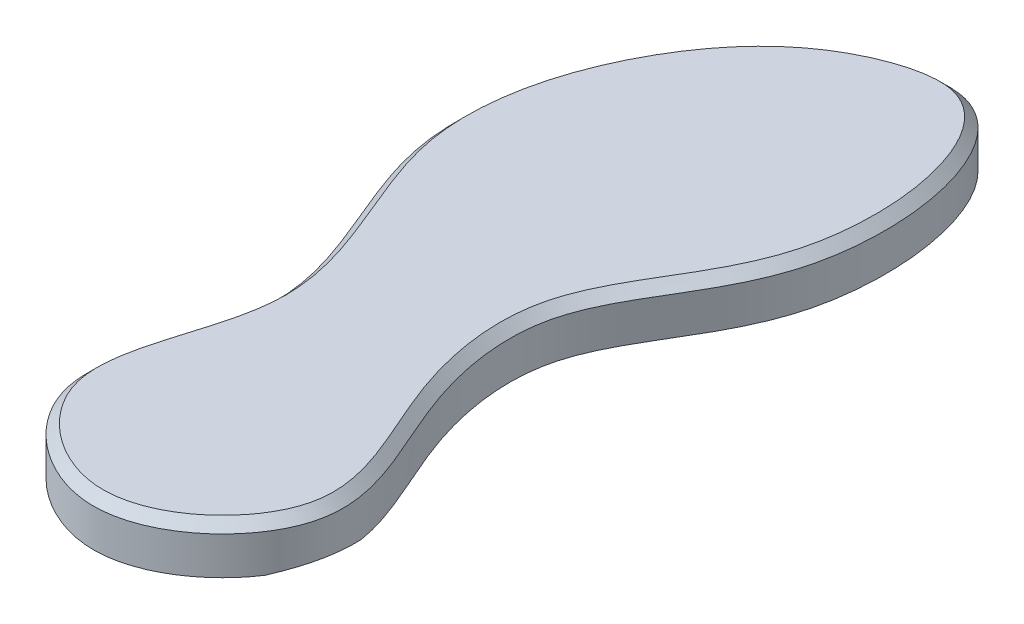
ISO-10303-21;
HEADER;
FILE_DESCRIPTION(('STEP AP214'),'2;1');
FILE_NAME('part.step','',(''),(''),'','','');
FILE_SCHEMA(('AUTOMOTIVE_DESIGN { 1 0 10303 214 1 1 1 1 }'));
ENDSEC;
DATA;
#1=APPLICATION_CONTEXT('core data for automotive mechanical design processes');
#2=APPLICATION_PROTOCOL_DEFINITION('international standard','automotive_design',2000,#1);
#3=PRODUCT_CONTEXT('',#1,'mechanical');
#4=PRODUCT('Part','Part','',(#3));
#5=PRODUCT_RELATED_PRODUCT_CATEGORY('part','',(#4));
#6=PRODUCT_DEFINITION_FORMATION('','',#4);
#7=PRODUCT_DEFINITION_CONTEXT('part definition',#1,'design');
#8=PRODUCT_DEFINITION('design','',#6,#7);
#9=PRODUCT_DEFINITION_SHAPE('','',#8);
#10=(LENGTH_UNIT() NAMED_UNIT(*) SI_UNIT(.MILLI.,.METRE.));
#11=(NAMED_UNIT(*) PLANE_ANGLE_UNIT() SI_UNIT($,.RADIAN.));
#12=(NAMED_UNIT(*) SI_UNIT($,.STERADIAN.) SOLID_ANGLE_UNIT());
#13=UNCERTAINTY_MEASURE_WITH_UNIT(LENGTH_MEASURE(1.E-05),#10,'distance_accuracy_value','');
#14=(GEOMETRIC_REPRESENTATION_CONTEXT(3) GLOBAL_UNCERTAINTY_ASSIGNED_CONTEXT((#13)) GLOBAL_UNIT_ASSIGNED_CONTEXT((#10,
#11,#12)) REPRESENTATION_CONTEXT('',''));
#15=CARTESIAN_POINT('',(0.,0.,0.));
#16=DIRECTION('',(0.,0.,1.));
#17=DIRECTION('',(1.,0.,0.));
#18=AXIS2_PLACEMENT_3D('',#15,#16,#17);
#19=CARTESIAN_POINT('',(-24.5941986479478,12.7,-61.4030999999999));
#20=CARTESIAN_POINT('',(-33.6131581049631,12.7,-45.5760031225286));
#21=CARTESIAN_POINT('',(-43.5986194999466,12.7,-5.77703476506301));
#22=CARTESIAN_POINT('',(-6.27767952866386,12.7,42.7483798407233));
#23=CARTESIAN_POINT('',(-39.3860985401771,12.7,93.5623560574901));
#24=CARTESIAN_POINT('',(6.61031610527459,12.7,129.058557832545));
#25=CARTESIAN_POINT('',(49.9973174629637,12.7,89.9814839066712));
#26=CARTESIAN_POINT('',(24.7011234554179,12.7,51.5524334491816));
#27=CARTESIAN_POINT('',(17.0274495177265,12.7,5.2469350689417));
#28=CARTESIAN_POINT('',(55.6838817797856,12.7,-29.833997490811));
#29=CARTESIAN_POINT('',(42.3806041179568,12.7,-101.518714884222));
#30=CARTESIAN_POINT('',(-2.95094654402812,12.7,-89.5582269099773));
#31=CARTESIAN_POINT('',(-17.4158647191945,12.7,-74.0001392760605));
#32=CARTESIAN_POINT('',(-24.5941986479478,12.7,-61.4030999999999));
#33=B_SPLINE_CURVE_WITH_KNOTS('',3,(#19,#20,#21,#22,#23,#24,#25,#26,#27,#28,#29,#30,#31,#32),
.UNSPECIFIED.,.T.,.F.,(4,1,1,1,1,1,1,1,1,1,1,4),(0.,0.107319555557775,0.225591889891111,
0.322653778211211,0.398428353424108,0.484136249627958,0.57299417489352,0.643234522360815,
0.748295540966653,0.874974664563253,0.914582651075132,1.),.UNSPECIFIED.);
#34=DIRECTION('',(0.,-1.,0.));
#35=VECTOR('',#34,1.);
#36=SURFACE_OF_LINEAR_EXTRUSION('',#33,#35);
#37=CARTESIAN_POINT('',(-24.5941986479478,0.,-61.4030999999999));
#38=CARTESIAN_POINT('',(-33.6131581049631,0.,-45.5760031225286));
#39=CARTESIAN_POINT('',(-43.5986194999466,0.,-5.77703476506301));
#40=CARTESIAN_POINT('',(-6.27767952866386,0.,42.7483798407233));
#41=CARTESIAN_POINT('',(-39.3860985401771,0.,93.5623560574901));
#42=CARTESIAN_POINT('',(6.61031610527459,0.,129.058557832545));
#43=CARTESIAN_POINT('',(49.9973174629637,0.,89.9814839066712));
#44=CARTESIAN_POINT('',(24.7011234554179,0.,51.5524334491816));
#45=CARTESIAN_POINT('',(17.0274495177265,0.,5.2469350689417));
#46=CARTESIAN_POINT('',(55.6838817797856,0.,-29.833997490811));
#47=CARTESIAN_POINT('',(42.3806041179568,0.,-101.518714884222));
#48=CARTESIAN_POINT('',(-2.95094654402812,0.,-89.5582269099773));
#49=CARTESIAN_POINT('',(-17.4158647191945,0.,-74.0001392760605));
#50=CARTESIAN_POINT('',(-24.5941986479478,0.,-61.4030999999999));
#51=B_SPLINE_CURVE_WITH_KNOTS('',3,(#37,#38,#39,#40,#41,#42,#43,#44,#45,#46,#47,#48,#49,#50),
.UNSPECIFIED.,.T.,.F.,(4,1,1,1,1,1,1,1,1,1,1,4),(0.,0.107319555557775,0.225591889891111,
0.322653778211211,0.398428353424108,0.484136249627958,0.57299417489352,0.643234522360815,
0.748295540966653,0.874974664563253,0.914582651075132,1.),.UNSPECIFIED.);
#52=CARTESIAN_POINT('',(-35.4070316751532,0.,-30.2954586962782));
#53=VERTEX_POINT('',#52);
#54=CARTESIAN_POINT('',(33.493365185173,0.,100.135559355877));
#55=VERTEX_POINT('',#54);
#56=EDGE_CURVE('E73',#53,#55,#51,.T.);
#57=ORIENTED_EDGE('',*,*,#56,.T.);
#58=CARTESIAN_POINT('',(33.4933651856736,-6.97935153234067E-09,100.135559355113));
#59=CARTESIAN_POINT('',(33.7764018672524,0.0675880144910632,99.7035891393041));
#60=CARTESIAN_POINT('',(34.0506461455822,0.131562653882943,99.2652927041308));
#61=CARTESIAN_POINT('',(34.5801501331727,0.25181446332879,98.3764039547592));
#62=CARTESIAN_POINT('',(34.8354123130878,0.308092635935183,97.9258132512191));
#63=CARTESIAN_POINT('',(35.3254507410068,0.412438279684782,97.0126093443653));
#64=CARTESIAN_POINT('',(35.560224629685,0.46050480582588,96.5499947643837));
#65=CARTESIAN_POINT('',(36.0067614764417,0.54768283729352,95.6147529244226));
#66=CARTESIAN_POINT('',(36.2185952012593,0.586822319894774,95.1421621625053));
#67=CARTESIAN_POINT('',(36.618098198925,0.655676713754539,94.1861967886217));
#68=CARTESIAN_POINT('',(36.805768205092,0.685391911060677,93.7028225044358));
#69=CARTESIAN_POINT('',(37.1546969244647,0.734662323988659,92.7261251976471));
#70=CARTESIAN_POINT('',(37.3159595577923,0.754219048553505,92.2328036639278));
#71=CARTESIAN_POINT('',(37.5370252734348,0.775423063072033,91.4834261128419));
#72=CARTESIAN_POINT('',(37.6075795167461,0.781144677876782,91.2306181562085));
#73=CARTESIAN_POINT('',(37.7409496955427,0.789675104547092,90.7229220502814));
#74=CARTESIAN_POINT('',(37.8037657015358,0.792483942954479,90.4680339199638));
#75=CARTESIAN_POINT('',(37.9801973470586,0.796418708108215,89.7005485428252));
#76=CARTESIAN_POINT('',(38.081803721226,0.793053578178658,89.1851063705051));
#77=CARTESIAN_POINT('',(38.252975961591,0.774543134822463,88.1492649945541));
#78=CARTESIAN_POINT('',(38.322545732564,0.759399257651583,87.6288664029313));
#79=CARTESIAN_POINT('',(38.4303801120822,0.717743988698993,86.5850821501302));
#80=CARTESIAN_POINT('',(38.4686314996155,0.69122780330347,86.0616953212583));
#81=CARTESIAN_POINT('',(38.5151101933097,0.627456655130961,85.0141901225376));
#82=CARTESIAN_POINT('',(38.5233322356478,0.590199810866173,84.4900716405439));
#83=CARTESIAN_POINT('',(38.5115551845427,0.505731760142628,83.4429673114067));
#84=CARTESIAN_POINT('',(38.4915545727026,0.458520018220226,82.9199815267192));
#85=CARTESIAN_POINT('',(38.4245899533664,0.353626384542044,81.8625778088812));
#86=CARTESIAN_POINT('',(38.3769157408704,0.295697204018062,81.3282303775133));
#87=CARTESIAN_POINT('',(38.2565806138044,0.171237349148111,80.2633035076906));
#88=CARTESIAN_POINT('',(38.183914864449,0.104705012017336,79.7327248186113));
#89=CARTESIAN_POINT('',(38.0161343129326,-0.036012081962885,78.6759376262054));
#90=CARTESIAN_POINT('',(37.9210092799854,-0.110200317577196,78.1497312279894));
#91=CARTESIAN_POINT('',(37.7108543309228,-0.265272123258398,77.1023650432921));
#92=CARTESIAN_POINT('',(37.5958253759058,-0.346155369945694,76.5812050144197));
#93=CARTESIAN_POINT('',(37.3475486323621,-0.514236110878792,75.5410774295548));
#94=CARTESIAN_POINT('',(37.2142006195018,-0.601467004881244,75.0221393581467));
#95=CARTESIAN_POINT('',(36.9320549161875,-0.781034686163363,73.9893653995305));
#96=CARTESIAN_POINT('',(36.7832563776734,-0.873371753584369,73.475529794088));
#97=CARTESIAN_POINT('',(36.4723908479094,-1.06237041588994,72.4530295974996));
#98=CARTESIAN_POINT('',(36.3103312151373,-1.1590295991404,71.9443623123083));
#99=CARTESIAN_POINT('',(35.9747848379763,-1.3560651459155,70.9315751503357));
#100=CARTESIAN_POINT('',(35.8012985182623,-1.45644137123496,70.4274551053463));
#101=CARTESIAN_POINT('',(35.4338584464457,-1.6664876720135,69.3929785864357));
#102=CARTESIAN_POINT('',(35.2393013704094,-1.77635288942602,68.8628767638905));
#103=CARTESIAN_POINT('',(34.8411712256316,-1.99898303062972,67.806693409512));
#104=CARTESIAN_POINT('',(34.6375981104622,-2.11174796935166,67.2806118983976));
#105=CARTESIAN_POINT('',(34.2231482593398,-2.33961712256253,66.2318321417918));
#106=CARTESIAN_POINT('',(34.0122712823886,-2.45472141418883,65.709134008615));
#107=CARTESIAN_POINT('',(33.5847895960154,-2.68675705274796,64.6664885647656));
#108=CARTESIAN_POINT('',(33.3681847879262,-2.80368843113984,64.1465413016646));
#109=CARTESIAN_POINT('',(32.7116790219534,-3.15667954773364,62.5890972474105));
#110=CARTESIAN_POINT('',(32.2653937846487,-3.39476843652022,61.5547622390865));
#111=CARTESIAN_POINT('',(31.3661493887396,-3.87313867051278,59.4884681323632));
#112=CARTESIAN_POINT('',(30.9131849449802,-4.11342168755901,58.4565117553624));
#113=CARTESIAN_POINT('',(30.0105044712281,-4.5930298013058,56.3900179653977));
#114=CARTESIAN_POINT('',(29.5607910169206,-4.83235408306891,55.3554792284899));
#115=CARTESIAN_POINT('',(28.6771370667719,-5.30545755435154,53.2855279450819));
#116=CARTESIAN_POINT('',(28.2431221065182,-5.53926035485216,52.2501530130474));
#117=CARTESIAN_POINT('',(27.6094536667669,-5.88441002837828,50.689002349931));
#118=CARTESIAN_POINT('',(27.4011542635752,-5.99851683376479,50.1673525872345));
#119=CARTESIAN_POINT('',(26.9916091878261,-6.22447023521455,49.1207982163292));
#120=CARTESIAN_POINT('',(26.7903634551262,-6.33631685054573,48.5958936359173));
#121=CARTESIAN_POINT('',(26.4949227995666,-6.50199601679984,47.8059759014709));
#122=CARTESIAN_POINT('',(26.3975559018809,-6.55684994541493,47.5423613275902));
#123=CARTESIAN_POINT('',(26.2050358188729,-6.66584331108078,47.0141779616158));
#124=CARTESIAN_POINT('',(26.1098826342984,-6.71998274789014,46.7496091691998));
#125=CARTESIAN_POINT('',(25.8277895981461,-6.88131194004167,45.954484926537));
#126=CARTESIAN_POINT('',(25.6442154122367,-6.98741305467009,45.422509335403));
#127=CARTESIAN_POINT('',(25.2865679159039,-7.19649042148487,44.3552243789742));
#128=CARTESIAN_POINT('',(25.1124875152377,-7.2994689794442,43.8199178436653));
#129=CARTESIAN_POINT('',(24.7740937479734,-7.50223240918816,42.7456334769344));
#130=CARTESIAN_POINT('',(24.6097804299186,-7.60201726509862,42.2066556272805));
#131=CARTESIAN_POINT('',(24.1322230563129,-7.8962972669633,40.5845226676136));
#132=CARTESIAN_POINT('',(23.8342618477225,-8.08577604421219,39.4958719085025));
#133=CARTESIAN_POINT('',(23.3883178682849,-8.38040818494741,37.7224299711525));
#134=CARTESIAN_POINT('',(23.2264566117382,-8.49017606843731,37.0418584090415));
#135=CARTESIAN_POINT('',(22.9210302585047,-8.70360981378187,35.6753957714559));
#136=CARTESIAN_POINT('',(22.7774714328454,-8.80727357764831,34.9895029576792));
#137=CARTESIAN_POINT('',(22.5099475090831,-9.00800436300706,33.6128287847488));
#138=CARTESIAN_POINT('',(22.385985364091,-9.10507038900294,32.9220467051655));
#139=CARTESIAN_POINT('',(22.159049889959,-9.29207993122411,31.5359773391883));
#140=CARTESIAN_POINT('',(22.056079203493,-9.38202254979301,30.8406894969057));
#141=CARTESIAN_POINT('',(21.8725128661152,-9.55433996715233,29.4449836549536));
#142=CARTESIAN_POINT('',(21.791955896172,-9.63670152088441,28.7445589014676));
#143=CARTESIAN_POINT('',(21.6551341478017,-9.79303126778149,27.3404497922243));
#144=CARTESIAN_POINT('',(21.5988671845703,-9.86700021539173,26.6367657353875));
#145=CARTESIAN_POINT('',(21.512440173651,-10.0058352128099,25.226970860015));
#146=CARTESIAN_POINT('',(21.4822767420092,-10.0707024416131,24.5208603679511));
#147=CARTESIAN_POINT('',(21.4499959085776,-10.1905825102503,23.1070154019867));
#148=CARTESIAN_POINT('',(21.4478827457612,-10.2455938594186,22.3992806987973));
#149=CARTESIAN_POINT('',(21.4715850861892,-10.3364912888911,21.1036569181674));
#150=CARTESIAN_POINT('',(21.4927250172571,-10.3740386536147,20.5157978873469));
#151=CARTESIAN_POINT('',(21.5570041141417,-10.4412500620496,19.3408089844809));
#152=CARTESIAN_POINT('',(21.6001432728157,-10.4709141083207,18.7536791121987));
#153=CARTESIAN_POINT('',(21.7096433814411,-10.5218284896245,17.5813928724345));
#154=CARTESIAN_POINT('',(21.7759969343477,-10.5430815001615,16.9962359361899));
#155=CARTESIAN_POINT('',(21.9331186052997,-10.5766546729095,15.8291313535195));
#156=CARTESIAN_POINT('',(22.0238784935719,-10.5889778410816,15.2471826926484));
#157=CARTESIAN_POINT('',(22.2304551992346,-10.6041345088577,14.0907763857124));
#158=CARTESIAN_POINT('',(22.3461368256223,-10.6070178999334,13.5162953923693));
#159=CARTESIAN_POINT('',(22.6038366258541,-10.6029647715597,12.3731933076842));
#160=CARTESIAN_POINT('',(22.7458598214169,-10.596026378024,11.8045733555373));
#161=CARTESIAN_POINT('',(23.0543909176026,-10.5729168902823,10.6741283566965));
#162=CARTESIAN_POINT('',(23.2209032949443,-10.5567441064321,10.1123045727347));
#163=CARTESIAN_POINT('',(23.576297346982,-10.5158578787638,8.99624274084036));
#164=CARTESIAN_POINT('',(23.7651747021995,-10.4911460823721,8.44200325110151));
#165=CARTESIAN_POINT('',(24.1718021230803,-10.432703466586,7.31716760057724));
#166=CARTESIAN_POINT('',(24.3904537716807,-10.3986254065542,6.74691648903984));
#167=CARTESIAN_POINT('',(24.84715267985,-10.3229319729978,5.61471352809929));
#168=CARTESIAN_POINT('',(25.0852021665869,-10.2813157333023,5.05276264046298));
#169=CARTESIAN_POINT('',(25.8249264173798,-10.1465137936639,3.37803933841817));
#170=CARTESIAN_POINT('',(26.351874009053,-10.0434200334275,2.27721326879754));
#171=CARTESIAN_POINT('',(27.4536916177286,-9.81818095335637,0.10165550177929));
#172=CARTESIAN_POINT('',(28.0285846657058,-9.69602645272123,-0.973063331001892));
#173=CARTESIAN_POINT('',(29.2166167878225,-9.43774965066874,-3.11780916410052));
#174=CARTESIAN_POINT('',(29.830156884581,-9.30146595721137,-4.18759216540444));
#175=CARTESIAN_POINT('',(31.0726122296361,-9.02259664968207,-6.31631407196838));
#176=CARTESIAN_POINT('',(31.701517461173,-8.88001509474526,-7.37525943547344));
#177=CARTESIAN_POINT('',(32.9616955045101,-8.59395023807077,-9.4923760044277));
#178=CARTESIAN_POINT('',(33.5929693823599,-8.45046650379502,-10.5505465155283));
#179=CARTESIAN_POINT('',(34.6564730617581,-8.21032245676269,-12.3538783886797));
#180=CARTESIAN_POINT('',(35.0913784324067,-8.11257738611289,-13.0973078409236));
#181=CARTESIAN_POINT('',(35.9521880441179,-7.9207491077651,-14.5901566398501));
#182=CARTESIAN_POINT('',(36.3780895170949,-7.82666701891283,-15.3395777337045));
#183=CARTESIAN_POINT('',(37.2167282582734,-7.64378008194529,-16.8461594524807));
#184=CARTESIAN_POINT('',(37.6294689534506,-7.55497385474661,-17.6033179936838));
#185=CARTESIAN_POINT('',(38.4378870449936,-7.38414827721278,-19.1269701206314));
#186=CARTESIAN_POINT('',(38.8335732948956,-7.30212538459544,-19.8934585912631));
#187=CARTESIAN_POINT('',(39.6042540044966,-7.1462677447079,-21.4372084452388));
#188=CARTESIAN_POINT('',(39.979257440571,-7.07242943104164,-22.2144649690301));
#189=CARTESIAN_POINT('',(40.705228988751,-6.93422859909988,-23.7810292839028));
#190=CARTESIAN_POINT('',(41.0561963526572,-6.86986637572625,-24.5703374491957));
#191=CARTESIAN_POINT('',(41.7272232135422,-6.75245618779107,-26.1530900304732));
#192=CARTESIAN_POINT('',(42.0475669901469,-6.69929717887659,-26.9464053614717));
#193=CARTESIAN_POINT('',(42.6587012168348,-6.60446730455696,-28.545726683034));
#194=CARTESIAN_POINT('',(42.9494707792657,-6.56280452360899,-29.3517411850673));
#195=CARTESIAN_POINT('',(43.3613395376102,-6.5096160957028,-30.5694346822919));
#196=CARTESIAN_POINT('',(43.4945977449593,-6.49343603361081,-30.976832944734));
#197=CARTESIAN_POINT('',(43.7527350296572,-6.46426937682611,-31.7943964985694));
#198=CARTESIAN_POINT('',(43.8776141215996,-6.45128277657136,-32.2045617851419));
#199=CARTESIAN_POINT('',(44.1187611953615,-6.4285761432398,-33.0275362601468));
#200=CARTESIAN_POINT('',(44.2350285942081,-6.41885633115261,-33.4403456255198));
#201=CARTESIAN_POINT('',(44.4586752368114,-6.40276813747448,-34.2684294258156));
#202=CARTESIAN_POINT('',(44.56605450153,-6.39639974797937,-34.6837038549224));
#203=CARTESIAN_POINT('',(44.7720430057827,-6.38695368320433,-35.5164740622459));
#204=CARTESIAN_POINT('',(44.870651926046,-6.38387612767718,-35.9339699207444));
#205=CARTESIAN_POINT('',(45.059425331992,-6.38087199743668,-36.7708714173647));
#206=CARTESIAN_POINT('',(45.1495897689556,-6.38094544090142,-37.1902770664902));
#207=CARTESIAN_POINT('',(45.4077424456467,-6.38572727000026,-38.4507198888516));
#208=CARTESIAN_POINT('',(45.5634636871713,-6.39499392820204,-39.2942825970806));
#209=CARTESIAN_POINT('',(45.8506204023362,-6.42563227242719,-41.0265914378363));
#210=CARTESIAN_POINT('',(45.9805456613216,-6.44755955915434,-41.9155757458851));
#211=CARTESIAN_POINT('',(46.2079967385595,-6.50323142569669,-43.6973196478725));
#212=CARTESIAN_POINT('',(46.3055217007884,-6.53697631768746,-44.5900793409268));
#213=CARTESIAN_POINT('',(46.4693701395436,-6.61576359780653,-46.3781536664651));
#214=CARTESIAN_POINT('',(46.5356863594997,-6.66080860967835,-47.2734688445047));
#215=CARTESIAN_POINT('',(46.6379260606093,-6.76181709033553,-49.0654634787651));
#216=CARTESIAN_POINT('',(46.6738409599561,-6.81778363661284,-49.9621432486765));
#217=CARTESIAN_POINT('',(46.7157515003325,-6.94037655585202,-51.7556910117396));
#218=CARTESIAN_POINT('',(46.7217397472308,-7.00700555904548,-52.6525589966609));
#219=CARTESIAN_POINT('',(46.7039069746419,-7.15125079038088,-54.4512640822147));
#220=CARTESIAN_POINT('',(46.6798826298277,-7.22893876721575,-55.3530934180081));
#221=CARTESIAN_POINT('',(46.6015759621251,-7.39488515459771,-57.154202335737));
#222=CARTESIAN_POINT('',(46.5473024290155,-7.48314048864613,-58.0534825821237));
#223=CARTESIAN_POINT('',(46.4081078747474,-7.67026103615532,-59.8482001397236));
#224=CARTESIAN_POINT('',(46.3231991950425,-7.7691219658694,-60.7436388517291));
#225=CARTESIAN_POINT('',(46.1220336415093,-7.97760125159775,-62.5293459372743));
#226=CARTESIAN_POINT('',(46.005790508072,-8.08721487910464,-63.4196164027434));
#227=CARTESIAN_POINT('',(45.740904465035,-8.31746649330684,-65.1935884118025));
#228=CARTESIAN_POINT('',(45.5922722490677,-8.43810083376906,-66.077292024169));
#229=CARTESIAN_POINT('',(45.2096532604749,-8.73011005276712,-68.1104092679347));
#230=CARTESIAN_POINT('',(44.9634973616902,-8.90559639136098,-69.2569746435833));
#231=CARTESIAN_POINT('',(44.4087049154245,-9.27738912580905,-71.5317033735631));
#232=CARTESIAN_POINT('',(44.1000670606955,-9.47369595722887,-72.6598663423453));
#233=CARTESIAN_POINT('',(43.5867030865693,-9.78448400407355,-74.3311460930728));
#234=CARTESIAN_POINT('',(43.4075514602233,-9.89059383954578,-74.8837602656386));
#235=CARTESIAN_POINT('',(43.0314982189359,-10.1085739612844,-75.9817485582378));
#236=CARTESIAN_POINT('',(42.8345979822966,-10.220443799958,-76.5271232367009));
#237=CARTESIAN_POINT('',(42.4221569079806,-10.4501655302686,-77.6093897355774));
#238=CARTESIAN_POINT('',(42.2066198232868,-10.5680162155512,-78.1462832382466));
#239=CARTESIAN_POINT('',(41.7558687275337,-10.8099673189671,-79.2102693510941));
#240=CARTESIAN_POINT('',(41.5206560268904,-10.9340673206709,-79.7373626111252));
#241=CARTESIAN_POINT('',(40.9271751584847,-11.2418214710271,-80.9972520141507));
#242=CARTESIAN_POINT('',(40.5584310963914,-11.4287677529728,-81.7243711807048));
#243=CARTESIAN_POINT('',(39.7758147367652,-11.8165378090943,-83.1501834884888));
#244=CARTESIAN_POINT('',(39.3619411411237,-12.0173619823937,-83.8488758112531));
#245=CARTESIAN_POINT('',(38.4855154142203,-12.4335982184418,-85.2106237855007));
#246=CARTESIAN_POINT('',(38.0229747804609,-12.6490068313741,-85.8736877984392));
#247=CARTESIAN_POINT('',(37.2904351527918,-12.9833103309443,-86.8345109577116));
#248=CARTESIAN_POINT('',(37.0398299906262,-13.0965969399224,-87.1491240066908));
#249=CARTESIAN_POINT('',(36.5252557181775,-13.3269738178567,-87.7659419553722));
#250=CARTESIAN_POINT('',(36.2612833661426,-13.4440650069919,-88.0681438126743));
#251=CARTESIAN_POINT('',(35.5958091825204,-13.7364759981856,-88.7937877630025));
#252=CARTESIAN_POINT('',(35.1866513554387,-13.9139215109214,-89.2094255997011));
#253=CARTESIAN_POINT('',(34.3393059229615,-14.2764902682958,-90.006120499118));
#254=CARTESIAN_POINT('',(33.9011269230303,-14.4616112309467,-90.3871877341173));
#255=CARTESIAN_POINT('',(32.996731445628,-14.8387472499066,-91.1091252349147));
#256=CARTESIAN_POINT('',(32.5305654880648,-15.0307496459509,-91.4500648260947));
#257=CARTESIAN_POINT('',(31.8110339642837,-15.3233973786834,-91.9279198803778));
#258=CARTESIAN_POINT('',(31.567767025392,-15.4217375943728,-92.0816355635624));
#259=CARTESIAN_POINT('',(31.0747383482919,-15.6198265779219,-92.3772974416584));
#260=CARTESIAN_POINT('',(30.8249768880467,-15.7195752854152,-92.5192441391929));
#261=CARTESIAN_POINT('',(30.2322050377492,-15.954890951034,-92.8375710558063));
#262=CARTESIAN_POINT('',(29.8867052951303,-16.0909619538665,-93.0089728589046));
#263=CARTESIAN_POINT('',(29.1856835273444,-16.3648669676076,-93.3282594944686));
#264=CARTESIAN_POINT('',(28.8301615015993,-16.5027009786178,-93.4761443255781));
#265=CARTESIAN_POINT('',(28.1104655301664,-16.7795715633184,-93.7474466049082));
#266=CARTESIAN_POINT('',(27.7462936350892,-16.9186078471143,-93.8708697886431));
#267=CARTESIAN_POINT('',(27.0105342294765,-17.1974028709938,-94.0927241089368));
#268=CARTESIAN_POINT('',(26.6389447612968,-17.3371617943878,-94.1911485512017));
#269=CARTESIAN_POINT('',(26.0772890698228,-17.546867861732,-94.3198443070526));
#270=CARTESIAN_POINT('',(25.8893347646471,-17.6167899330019,-94.359589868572));
#271=CARTESIAN_POINT('',(25.5121789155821,-17.7565930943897,-94.4327580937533));
#272=CARTESIAN_POINT('',(25.3229773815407,-17.8264741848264,-94.4661808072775));
#273=CARTESIAN_POINT('',(24.9435387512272,-17.9661323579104,-94.5268636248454));
#274=CARTESIAN_POINT('',(24.7533015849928,-18.0359094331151,-94.5541233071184));
#275=CARTESIAN_POINT('',(24.3720205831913,-18.1752991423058,-94.6027540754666));
#276=CARTESIAN_POINT('',(24.1809767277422,-18.2449117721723,-94.6241250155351));
#277=CARTESIAN_POINT('',(23.5006799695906,-18.4920206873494,-94.6900796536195));
#278=CARTESIAN_POINT('',(23.0096441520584,-18.6689570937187,-94.7190861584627));
#279=CARTESIAN_POINT('',(22.0259631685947,-19.0208920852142,-94.7443542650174));
#280=CARTESIAN_POINT('',(21.5333174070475,-19.1958898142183,-94.7406019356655));
#281=CARTESIAN_POINT('',(20.5482435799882,-19.5435764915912,-94.7039929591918));
#282=CARTESIAN_POINT('',(20.0558155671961,-19.7162650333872,-94.6711312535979));
#283=CARTESIAN_POINT('',(19.0701597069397,-20.0599242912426,-94.5792893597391));
#284=CARTESIAN_POINT('',(18.5769395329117,-20.2308826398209,-94.52018346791));
#285=CARTESIAN_POINT('',(17.5931226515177,-20.5700782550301,-94.3786545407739));
#286=CARTESIAN_POINT('',(17.10252518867,-20.7383163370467,-94.2962386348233));
#287=CARTESIAN_POINT('',(16.1244092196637,-21.0720915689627,-94.110466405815));
#288=CARTESIAN_POINT('',(15.6368908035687,-21.2376286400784,-94.0071094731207));
#289=CARTESIAN_POINT('',(14.459995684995,-21.6354191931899,-93.7338005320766));
#290=CARTESIAN_POINT('',(13.7723969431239,-21.8662977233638,-93.554165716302));
#291=CARTESIAN_POINT('',(12.4047820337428,-22.3227811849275,-93.1613000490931));
#292=CARTESIAN_POINT('',(11.7247697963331,-22.5483834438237,-92.9480525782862));
#293=CARTESIAN_POINT('',(10.3727354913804,-22.9944447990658,-92.4915545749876));
#294=CARTESIAN_POINT('',(9.70071835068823,-23.2149007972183,-92.248286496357));
#295=CARTESIAN_POINT('',(8.36531205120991,-23.6506629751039,-91.7346205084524));
#296=CARTESIAN_POINT('',(7.70192437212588,-23.8659682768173,-91.4642180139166));
#297=CARTESIAN_POINT('',(6.71395719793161,-24.1849669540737,-91.0399886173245));
#298=CARTESIAN_POINT('',(6.38594493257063,-24.2906002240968,-90.8955334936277));
#299=CARTESIAN_POINT('',(5.7322388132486,-24.5005775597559,-90.6005670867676));
#300=CARTESIAN_POINT('',(5.40654495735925,-24.6049216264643,-90.4500558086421));
#301=CARTESIAN_POINT('',(4.43343165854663,-24.9158569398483,-89.9895876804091));
#302=CARTESIAN_POINT('',(3.78964390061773,-25.1204599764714,-89.6705519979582));
#303=CARTESIAN_POINT('',(2.51292124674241,-25.5239701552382,-89.0085535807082));
#304=CARTESIAN_POINT('',(1.87998353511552,-25.7228787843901,-88.6655971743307));
#305=CARTESIAN_POINT('',(0.625682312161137,-26.1147609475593,-87.9559849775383));
#306=CARTESIAN_POINT('',(0.00431847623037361,-26.3077346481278,-87.5893298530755));
#307=CARTESIAN_POINT('',(-1.26543598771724,-26.6996542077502,-86.808487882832));
#308=CARTESIAN_POINT('',(-1.91300657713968,-26.8981902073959,-86.3927607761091));
#309=CARTESIAN_POINT('',(-3.19328234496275,-27.2879961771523,-85.5355214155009));
#310=CARTESIAN_POINT('',(-3.8259846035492,-27.4792647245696,-85.094004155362));
#311=CARTESIAN_POINT('',(-5.07561087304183,-27.8542746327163,-84.1860144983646));
#312=CARTESIAN_POINT('',(-5.69253333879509,-28.0380152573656,-83.7195396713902));
#313=CARTESIAN_POINT('',(-6.90977898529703,-28.3977524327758,-82.7626162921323));
#314=CARTESIAN_POINT('',(-7.51010272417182,-28.5737492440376,-82.272168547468));
#315=CARTESIAN_POINT('',(-8.69313354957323,-28.9177420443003,-81.2686719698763));
#316=CARTESIAN_POINT('',(-9.27585293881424,-29.0857436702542,-80.7556395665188));
#317=CARTESIAN_POINT('',(-10.423605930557,-29.4137832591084,-79.7077792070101));
#318=CARTESIAN_POINT('',(-10.9886403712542,-29.5738215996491,-79.1729522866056));
#319=CARTESIAN_POINT('',(-12.1007055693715,-29.8859076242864,-78.0826261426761));
#320=CARTESIAN_POINT('',(-12.6477358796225,-30.0379551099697,-77.527126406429));
#321=CARTESIAN_POINT('',(-13.7235320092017,-30.3340602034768,-76.3966751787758));
#322=CARTESIAN_POINT('',(-14.252297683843,-30.4781177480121,-75.8217235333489));
#323=CARTESIAN_POINT('',(-15.5138191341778,-30.8182487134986,-74.4035847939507));
#324=CARTESIAN_POINT('',(-16.2370402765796,-31.0102013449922,-73.5508977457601));
#325=CARTESIAN_POINT('',(-17.6461682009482,-31.3782301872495,-71.8116128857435));
#326=CARTESIAN_POINT('',(-18.3320645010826,-31.5543019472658,-70.9250056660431));
#327=CARTESIAN_POINT('',(-19.666993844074,-31.8909815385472,-69.1211672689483));
#328=CARTESIAN_POINT('',(-20.31601404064,-32.0515839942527,-68.2039255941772));
#329=CARTESIAN_POINT('',(-21.5777310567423,-32.3577793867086,-66.3422398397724));
#330=CARTESIAN_POINT('',(-22.1904236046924,-32.5033705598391,-65.3977925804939));
#331=CARTESIAN_POINT('',(-23.3829753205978,-32.7807004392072,-63.4805908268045));
#332=CARTESIAN_POINT('',(-23.9626781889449,-32.9123753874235,-62.5077300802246));
#333=CARTESIAN_POINT('',(-25.087431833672,-33.1617646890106,-60.540731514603));
#334=CARTESIAN_POINT('',(-25.6324900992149,-33.2794820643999,-59.5465983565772));
#335=CARTESIAN_POINT('',(-26.6870486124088,-33.5007212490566,-57.5381944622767));
#336=CARTESIAN_POINT('',(-27.196552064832,-33.6042443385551,-56.5239255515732));
#337=CARTESIAN_POINT('',(-28.1788053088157,-33.7967527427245,-54.4763354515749));
#338=CARTESIAN_POINT('',(-28.6515529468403,-33.8857372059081,-53.4430131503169));
#339=CARTESIAN_POINT('',(-29.7216334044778,-34.0780014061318,-50.9846369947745));
#340=CARTESIAN_POINT('',(-30.3028326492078,-34.1749605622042,-49.5520154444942));
#341=CARTESIAN_POINT('',(-31.3906888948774,-34.3400830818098,-46.6571198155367));
#342=CARTESIAN_POINT('',(-31.8973466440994,-34.4082467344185,-45.1948460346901));
#343=CARTESIAN_POINT('',(-32.8315420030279,-34.514404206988,-42.2439693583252));
#344=CARTESIAN_POINT('',(-33.2590742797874,-34.5523959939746,-40.7553646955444));
#345=CARTESIAN_POINT('',(-34.0279162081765,-34.5965514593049,-37.7631587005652));
#346=CARTESIAN_POINT('',(-34.3696323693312,-34.6028679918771,-36.2596645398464));
#347=CARTESIAN_POINT('',(-34.9639252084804,-34.5824582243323,-33.2353722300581));
#348=CARTESIAN_POINT('',(-35.2165049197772,-34.5557330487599,-31.7145746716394));
#349=CARTESIAN_POINT('',(-35.6266348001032,-34.4675571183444,-28.6610620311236));
#350=CARTESIAN_POINT('',(-35.7841927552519,-34.406109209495,-27.1283479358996));
#351=CARTESIAN_POINT('',(-35.9415756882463,-34.2891074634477,-24.87182838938));
#352=CARTESIAN_POINT('',(-35.9807410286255,-34.2476910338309,-24.1498482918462));
#353=CARTESIAN_POINT('',(-36.0361816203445,-34.1566858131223,-22.7055232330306));
#354=CARTESIAN_POINT('',(-36.0524579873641,-34.107097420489,-21.9831782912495));
#355=CARTESIAN_POINT('',(-36.0615419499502,-33.9996174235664,-20.5391024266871));
#356=CARTESIAN_POINT('',(-36.0543541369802,-33.9417274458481,-19.8173714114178));
#357=CARTESIAN_POINT('',(-36.0159844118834,-33.8175284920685,-18.3754511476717));
#358=CARTESIAN_POINT('',(-35.9848087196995,-33.7512217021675,-17.6552615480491));
#359=CARTESIAN_POINT('',(-35.897987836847,-33.6100925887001,-16.2173712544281));
#360=CARTESIAN_POINT('',(-35.8423485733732,-33.5352723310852,-15.4996699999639));
#361=CARTESIAN_POINT('',(-35.7062191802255,-33.3770876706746,-14.0681531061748));
#362=CARTESIAN_POINT('',(-35.6257496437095,-33.2937303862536,-13.3543347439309));
#363=CARTESIAN_POINT('',(-35.4861309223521,-33.1622152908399,-12.2868766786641));
#364=CARTESIAN_POINT('',(-35.4364345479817,-33.1172934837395,-11.9315759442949));
#365=CARTESIAN_POINT('',(-35.3306962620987,-33.0252857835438,-11.2221964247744));
#366=CARTESIAN_POINT('',(-35.2746543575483,-32.9781998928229,-10.8681176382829));
#367=CARTESIAN_POINT('',(-35.1561981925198,-32.8818625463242,-10.1612871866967));
#368=CARTESIAN_POINT('',(-35.0937833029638,-32.8326108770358,-9.80853565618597));
#369=CARTESIAN_POINT('',(-34.9625215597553,-32.7319348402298,-9.10454331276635));
#370=CARTESIAN_POINT('',(-34.8936747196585,-32.6805104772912,-8.75330249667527));
#371=CARTESIAN_POINT('',(-34.7497469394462,-32.5755633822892,-8.05238282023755));
#372=CARTESIAN_POINT('',(-34.6746654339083,-32.52204046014,-7.70270410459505));
#373=CARTESIAN_POINT('',(-34.5186452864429,-32.4130347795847,-7.00496612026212));
#374=CARTESIAN_POINT('',(-34.4377066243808,-32.3575520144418,-6.65690685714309));
#375=CARTESIAN_POINT('',(-34.1866364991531,-32.1883662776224,-5.61533014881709));
#376=CARTESIAN_POINT('',(-34.0082164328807,-32.0719008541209,-4.92424750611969));
#377=CARTESIAN_POINT('',(-33.5890588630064,-31.805273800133,-3.39177644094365));
#378=CARTESIAN_POINT('',(-33.3433862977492,-31.653482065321,-2.55202903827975));
#379=CARTESIAN_POINT('',(-32.8274357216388,-31.3418489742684,-0.881731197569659));
#380=CARTESIAN_POINT('',(-32.5571586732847,-31.1820079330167,-0.0511804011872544));
#381=CARTESIAN_POINT('',(-31.9963470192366,-30.8557346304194,1.60187982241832));
#382=CARTESIAN_POINT('',(-31.7058087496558,-30.6893011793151,2.42438776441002));
#383=CARTESIAN_POINT('',(-31.1086521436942,-30.3512468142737,4.06243982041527));
#384=CARTESIAN_POINT('',(-30.8020337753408,-30.1796258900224,4.87798392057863));
#385=CARTESIAN_POINT('',(-30.1751428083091,-29.8316595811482,6.50732727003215));
#386=CARTESIAN_POINT('',(-29.8548130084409,-29.6552958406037,7.32110047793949));
#387=CARTESIAN_POINT('',(-29.2056654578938,-29.299871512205,8.94443121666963));
#388=CARTESIAN_POINT('',(-28.8768495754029,-29.1208115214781,9.75398962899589));
#389=CARTESIAN_POINT('',(-28.2142857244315,-28.7611230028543,11.3706761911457));
#390=CARTESIAN_POINT('',(-27.8805380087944,-28.580494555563,12.1778044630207));
#391=CARTESIAN_POINT('',(-27.2116206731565,-28.2187828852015,13.7913939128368));
#392=CARTESIAN_POINT('',(-26.8764510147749,-28.0376996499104,14.5978550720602));
#393=CARTESIAN_POINT('',(-26.2649217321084,-27.7068747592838,16.0749065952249));
#394=CARTESIAN_POINT('',(-25.9882317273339,-27.5570278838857,16.7453361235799));
#395=CARTESIAN_POINT('',(-25.4383835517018,-27.2584600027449,18.0879009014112));
#396=CARTESIAN_POINT('',(-25.1652253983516,-27.1097390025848,18.760036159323));
#397=CARTESIAN_POINT('',(-24.6245741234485,-26.8141071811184,20.1069866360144));
#398=CARTESIAN_POINT('',(-24.3570810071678,-26.6671963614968,20.7818018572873));
#399=CARTESIAN_POINT('',(-23.8299668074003,-26.3758928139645,22.1351211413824));
#400=CARTESIAN_POINT('',(-23.5703463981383,-26.231500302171,22.8136255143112));
#401=CARTESIAN_POINT('',(-23.0612816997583,-25.9459723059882,24.175377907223));
#402=CARTESIAN_POINT('',(-22.8118404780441,-25.8048378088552,24.8586272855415));
#403=CARTESIAN_POINT('',(-22.3270854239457,-25.5274760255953,26.2266830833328));
#404=CARTESIAN_POINT('',(-22.0917005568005,-25.3912257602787,26.9114595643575));
#405=CARTESIAN_POINT('',(-21.6361837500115,-25.1236831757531,28.2871313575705));
#406=CARTESIAN_POINT('',(-21.4160533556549,-24.992391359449,28.9780272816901));
#407=CARTESIAN_POINT('',(-20.9939482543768,-24.7357688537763,30.3663244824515));
#408=CARTESIAN_POINT('',(-20.7919701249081,-24.6104370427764,31.0637245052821));
#409=CARTESIAN_POINT('',(-20.4091781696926,-24.3667730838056,32.4654465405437));
#410=CARTESIAN_POINT('',(-20.2283614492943,-24.2484399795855,33.1697675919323));
#411=CARTESIAN_POINT('',(-19.8910047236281,-24.0198441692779,34.5858100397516));
#412=CARTESIAN_POINT('',(-19.7344728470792,-23.909584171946,35.2975338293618));
#413=CARTESIAN_POINT('',(-19.487342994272,-23.7266873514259,36.5362379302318));
#414=CARTESIAN_POINT('',(-19.3903167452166,-23.6518859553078,37.0616186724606));
#415=CARTESIAN_POINT('',(-19.2124209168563,-23.5077578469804,38.1159531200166));
#416=CARTESIAN_POINT('',(-19.1315536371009,-23.4384319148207,38.6449073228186));
#417=CARTESIAN_POINT('',(-18.9873381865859,-23.3057853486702,39.7057906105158));
#418=CARTESIAN_POINT('',(-18.9239845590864,-23.2424628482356,40.2377187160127));
#419=CARTESIAN_POINT('',(-18.8160701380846,-23.122322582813,41.3039466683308));
#420=CARTESIAN_POINT('',(-18.7714996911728,-23.0655014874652,41.8382451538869));
#421=CARTESIAN_POINT('',(-18.7023208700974,-22.9588284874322,42.908582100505));
#422=CARTESIAN_POINT('',(-18.6777031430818,-22.9089733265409,43.4446196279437));
#423=CARTESIAN_POINT('',(-18.6494874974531,-22.8166883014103,44.517394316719));
#424=CARTESIAN_POINT('',(-18.6458691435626,-22.7742512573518,45.054130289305));
#425=CARTESIAN_POINT('',(-18.6568510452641,-22.7164164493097,45.8594662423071));
#426=CARTESIAN_POINT('',(-18.6632488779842,-22.6981058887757,46.1279924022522));
#427=CARTESIAN_POINT('',(-18.6815999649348,-22.6634659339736,46.6649857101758));
#428=CARTESIAN_POINT('',(-18.6935531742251,-22.6471365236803,46.9334528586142));
#429=CARTESIAN_POINT('',(-18.7231420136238,-22.6165085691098,47.4702692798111));
#430=CARTESIAN_POINT('',(-18.7407793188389,-22.6022106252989,47.7386184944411));
#431=CARTESIAN_POINT('',(-18.7815600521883,-22.5755986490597,48.2749933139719));
#432=CARTESIAN_POINT('',(-18.8047035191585,-22.5632846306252,48.5430189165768));
#433=CARTESIAN_POINT('',(-18.8819002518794,-22.5291433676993,49.3466066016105));
#434=CARTESIAN_POINT('',(-18.9437128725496,-22.5101237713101,49.8815577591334));
#435=CARTESIAN_POINT('',(-19.0855892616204,-22.4787626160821,50.9490574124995));
#436=CARTESIAN_POINT('',(-19.165648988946,-22.4664195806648,51.4816064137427));
#437=CARTESIAN_POINT('',(-19.3615285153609,-22.4454740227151,52.6638752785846));
#438=CARTESIAN_POINT('',(-19.4813412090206,-22.4383410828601,53.3129573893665));
#439=CARTESIAN_POINT('',(-19.7408349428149,-22.431460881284,54.6069941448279));
#440=CARTESIAN_POINT('',(-19.8805122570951,-22.4317122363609,55.2519495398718));
#441=CARTESIAN_POINT('',(-20.1760882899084,-22.4382698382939,56.5381657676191));
#442=CARTESIAN_POINT('',(-20.3319892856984,-22.4445769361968,57.1794260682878));
#443=CARTESIAN_POINT('',(-20.6566092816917,-22.462007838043,58.4586074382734));
#444=CARTESIAN_POINT('',(-20.8253283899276,-22.4731316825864,59.096528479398));
#445=CARTESIAN_POINT('',(-21.1732388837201,-22.4990939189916,60.3725209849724));
#446=CARTESIAN_POINT('',(-21.3524742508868,-22.5139489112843,61.0105800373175));
#447=CARTESIAN_POINT('',(-21.7177099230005,-22.546232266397,62.2845279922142));
#448=CARTESIAN_POINT('',(-21.9037087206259,-22.5636600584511,62.9204173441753));
#449=CARTESIAN_POINT('',(-22.2796743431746,-22.6000249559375,64.1909246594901));
#450=CARTESIAN_POINT('',(-22.4696408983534,-22.6189619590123,64.8255427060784));
#451=CARTESIAN_POINT('',(-22.8508135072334,-22.6573072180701,66.0943844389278));
#452=CARTESIAN_POINT('',(-23.0420195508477,-22.6767154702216,66.7286081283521));
#453=CARTESIAN_POINT('',(-23.4107542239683,-22.7137447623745,67.9568909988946));
#454=CARTESIAN_POINT('',(-23.5883746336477,-22.7314006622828,68.55092143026));
#455=CARTESIAN_POINT('',(-23.9400529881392,-22.7653601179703,69.7400884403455));
#456=CARTESIAN_POINT('',(-24.1141108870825,-22.7816636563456,70.3352250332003));
#457=CARTESIAN_POINT('',(-24.4563262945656,-22.8120321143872,71.5273143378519));
#458=CARTESIAN_POINT('',(-24.624483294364,-22.826096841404,72.1242672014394));
#459=CARTESIAN_POINT('',(-24.952448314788,-22.8510594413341,73.3207327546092));
#460=CARTESIAN_POINT('',(-25.112253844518,-22.8619563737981,73.9202461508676));
#461=CARTESIAN_POINT('',(-25.4205817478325,-22.8795768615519,75.1213440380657));
#462=CARTESIAN_POINT('',(-25.5691197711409,-22.8863063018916,75.7229243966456));
#463=CARTESIAN_POINT('',(-25.8522852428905,-22.8945615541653,76.929400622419));
#464=CARTESIAN_POINT('',(-25.9869129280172,-22.8960874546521,77.5342964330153));
#465=CARTESIAN_POINT('',(-26.2390822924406,-22.8928025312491,78.7474461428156));
#466=CARTESIAN_POINT('',(-26.3566297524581,-22.8879938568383,79.3556988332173));
#467=CARTESIAN_POINT('',(-26.5712498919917,-22.8708288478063,80.5756300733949));
#468=CARTESIAN_POINT('',(-26.668325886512,-22.8584737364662,81.1873080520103));
#469=CARTESIAN_POINT('',(-26.8621378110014,-22.8202323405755,82.5855799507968));
#470=CARTESIAN_POINT('',(-26.9511686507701,-22.7915260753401,83.3731974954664));
#471=CARTESIAN_POINT('',(-27.0813261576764,-22.7168070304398,84.9518501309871));
#472=CARTESIAN_POINT('',(-27.1224524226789,-22.6707941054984,85.7428852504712));
#473=CARTESIAN_POINT('',(-27.1417880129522,-22.5868469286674,86.9275874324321));
#474=CARTESIAN_POINT('',(-27.1412115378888,-22.556441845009,87.3215014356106));
#475=CARTESIAN_POINT('',(-27.1250453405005,-22.4903487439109,88.1085619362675));
#476=CARTESIAN_POINT('',(-27.1094572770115,-22.4546613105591,88.5017085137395));
#477=CARTESIAN_POINT('',(-27.062329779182,-22.3777230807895,89.2865381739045));
#478=CARTESIAN_POINT('',(-27.0307891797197,-22.3364718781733,89.6782211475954));
#479=CARTESIAN_POINT('',(-26.9509392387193,-22.2481874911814,90.4591817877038));
#480=CARTESIAN_POINT('',(-26.9026320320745,-22.2011550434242,90.8484597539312));
#481=CARTESIAN_POINT('',(-26.7878168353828,-22.1004712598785,91.628880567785));
#482=CARTESIAN_POINT('',(-26.7210741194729,-22.0467398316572,92.0199787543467));
#483=CARTESIAN_POINT('',(-26.5691814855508,-21.9330678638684,92.7977371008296));
#484=CARTESIAN_POINT('',(-26.4840289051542,-21.8731264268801,93.184396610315));
#485=CARTESIAN_POINT('',(-26.2950725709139,-21.7470389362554,93.9520867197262));
#486=CARTESIAN_POINT('',(-26.1912709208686,-21.6808935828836,94.3331179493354));
#487=CARTESIAN_POINT('',(-26.0216108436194,-21.5771007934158,94.899559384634));
#488=CARTESIAN_POINT('',(-25.9627359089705,-21.5417434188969,95.087509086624));
#489=CARTESIAN_POINT('',(-25.8403618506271,-21.469521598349,95.4616054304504));
#490=CARTESIAN_POINT('',(-25.7768627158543,-21.4326571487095,95.6477520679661));
#491=CARTESIAN_POINT('',(-25.5792819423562,-21.3196689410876,96.2045558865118));
#492=CARTESIAN_POINT('',(-25.4384693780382,-21.2413655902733,96.5724048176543));
#493=CARTESIAN_POINT('',(-25.1402692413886,-21.079468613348,97.3001828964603));
#494=CARTESIAN_POINT('',(-24.9828782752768,-20.9958739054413,97.6601104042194));
#495=CARTESIAN_POINT('',(-24.6527193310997,-20.8238398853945,98.3717923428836));
#496=CARTESIAN_POINT('',(-24.4799466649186,-20.735399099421,98.7235442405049));
#497=CARTESIAN_POINT('',(-24.120186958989,-20.5541119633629,99.4185440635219));
#498=CARTESIAN_POINT('',(-23.9331988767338,-20.4612652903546,99.7617913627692));
#499=CARTESIAN_POINT('',(-23.4315595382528,-20.2154483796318,100.640031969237));
#500=CARTESIAN_POINT('',(-23.1067900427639,-20.0593849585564,101.168413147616));
#501=CARTESIAN_POINT('',(-22.4275074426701,-19.7383953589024,102.202738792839));
#502=CARTESIAN_POINT('',(-22.0729955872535,-19.5734695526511,102.708684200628));
#503=CARTESIAN_POINT('',(-21.337191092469,-19.2358207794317,103.697989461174));
#504=CARTESIAN_POINT('',(-20.9558974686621,-19.0630975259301,104.181348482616));
#505=CARTESIAN_POINT('',(-20.1687160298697,-18.7106147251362,105.125704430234));
#506=CARTESIAN_POINT('',(-19.7628054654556,-18.5308487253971,105.586679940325));
#507=CARTESIAN_POINT('',(-18.9288783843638,-18.1652204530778,106.485555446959));
#508=CARTESIAN_POINT('',(-18.5008635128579,-17.9793586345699,106.923457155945));
#509=CARTESIAN_POINT('',(-17.6245292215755,-17.6021988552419,107.775934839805));
#510=CARTESIAN_POINT('',(-17.1762093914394,-17.4109007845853,108.190510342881));
#511=CARTESIAN_POINT('',(-16.0110381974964,-16.9177251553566,109.215768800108));
#512=CARTESIAN_POINT('',(-15.2811092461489,-16.6124509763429,109.810063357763));
#513=CARTESIAN_POINT('',(-13.7812679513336,-15.9921616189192,110.940148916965));
#514=CARTESIAN_POINT('',(-13.0113540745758,-15.6771460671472,111.47593767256));
#515=CARTESIAN_POINT('',(-11.4355644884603,-15.0390196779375,112.486209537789));
#516=CARTESIAN_POINT('',(-10.6296911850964,-14.7159093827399,112.960696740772));
#517=CARTESIAN_POINT('',(-8.98551339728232,-14.0631354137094,113.844639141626));
#518=CARTESIAN_POINT('',(-8.1472114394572,-13.7334722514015,114.254099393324));
#519=CARTESIAN_POINT('',(-6.75591734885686,-13.1915953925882,114.865170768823));
#520=CARTESIAN_POINT('',(-6.21151168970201,-12.98082508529,115.087804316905));
#521=CARTESIAN_POINT('',(-5.11213233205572,-12.5577738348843,115.503729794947));
#522=CARTESIAN_POINT('',(-4.55715871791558,-12.3454929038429,115.697021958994));
#523=CARTESIAN_POINT('',(-3.43766190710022,-11.9199061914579,116.052654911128));
#524=CARTESIAN_POINT('',(-2.87313747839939,-11.7066002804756,116.214991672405));
#525=CARTESIAN_POINT('',(-1.73707668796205,-11.2800306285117,116.506573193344));
#526=CARTESIAN_POINT('',(-1.1655587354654,-11.066767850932,116.635890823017));
#527=CARTESIAN_POINT('',(-0.0157144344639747,-10.6404681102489,116.859983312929));
#528=CARTESIAN_POINT('',(0.562611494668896,-10.4274311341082,116.954760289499));
#529=CARTESIAN_POINT('',(1.72434671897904,-10.002351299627,117.10775585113));
#530=CARTESIAN_POINT('',(2.30775501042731,-9.7903082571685,117.165981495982));
#531=CARTESIAN_POINT('',(3.4819471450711,-9.36653351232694,117.244142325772));
#532=CARTESIAN_POINT('',(4.07275401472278,-9.15481444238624,117.263805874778));
#533=CARTESIAN_POINT('',(5.25538013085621,-8.73417104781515,117.261981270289));
#534=CARTESIAN_POINT('',(5.8471994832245,-8.52524703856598,117.240488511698));
#535=CARTESIAN_POINT('',(7.02926429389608,-8.11100541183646,117.157767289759));
#536=CARTESIAN_POINT('',(7.61950978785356,-7.90568771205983,117.096539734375));
#537=CARTESIAN_POINT('',(8.79720558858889,-7.49897245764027,116.935924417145));
#538=CARTESIAN_POINT('',(9.38464981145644,-7.29758179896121,116.836474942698));
#539=CARTESIAN_POINT('',(10.5538927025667,-6.89959418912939,116.601249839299));
#540=CARTESIAN_POINT('',(11.1356908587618,-6.70299767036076,116.465470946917));
#541=CARTESIAN_POINT('',(12.2919593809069,-6.31505268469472,116.15946791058));
#542=CARTESIAN_POINT('',(12.8664290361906,-6.12370472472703,115.989240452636));
#543=CARTESIAN_POINT('',(14.0810016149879,-5.72202144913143,115.591847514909));
#544=CARTESIAN_POINT('',(14.7198816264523,-5.51246870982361,115.360149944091));
#545=CARTESIAN_POINT('',(15.9845845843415,-5.10100430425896,114.857685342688));
#546=CARTESIAN_POINT('',(16.6104070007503,-4.89909294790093,114.586916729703));
#547=CARTESIAN_POINT('',(17.847461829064,-4.50327409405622,114.008692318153));
#548=CARTESIAN_POINT('',(18.4586937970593,-4.30936683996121,113.70123540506));
#549=CARTESIAN_POINT('',(19.6658382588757,-3.92967621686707,113.051454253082));
#550=CARTESIAN_POINT('',(20.2617331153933,-3.74390204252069,112.709091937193));
#551=CARTESIAN_POINT('',(21.436216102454,-3.3810134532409,111.991733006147));
#552=CARTESIAN_POINT('',(22.0148050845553,-3.20389861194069,111.616738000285));
#553=CARTESIAN_POINT('',(23.1534541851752,-2.85863302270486,110.835815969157));
#554=CARTESIAN_POINT('',(23.7135136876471,-2.69048257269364,110.429887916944));
#555=CARTESIAN_POINT('',(25.1539933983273,-2.26239111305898,109.32852941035));
#556=CARTESIAN_POINT('',(26.0185176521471,-2.00993758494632,108.609207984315));
#557=CARTESIAN_POINT('',(27.6902113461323,-1.53096973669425,107.098406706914));
#558=CARTESIAN_POINT('',(28.4973690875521,-1.30446070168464,106.306912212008));
#559=CARTESIAN_POINT('',(29.6593119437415,-0.985947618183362,105.068938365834));
#560=CARTESIAN_POINT('',(30.0384909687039,-0.88331910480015,104.647828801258));
#561=CARTESIAN_POINT('',(30.7796396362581,-0.685461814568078,103.788958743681));
#562=CARTESIAN_POINT('',(31.1416084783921,-0.590233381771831,103.351197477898));
#563=CARTESIAN_POINT('',(31.8469386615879,-0.407627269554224,102.459629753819));
#564=CARTESIAN_POINT('',(32.190307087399,-0.320246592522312,102.005829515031));
#565=CARTESIAN_POINT('',(32.8571483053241,-0.153774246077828,101.082445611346));
#566=CARTESIAN_POINT('',(33.1806241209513,-0.0746813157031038,100.612864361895));
#567=CARTESIAN_POINT('',(33.4933651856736,-6.97935153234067E-09,100.135559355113));
#568=B_SPLINE_CURVE_WITH_KNOTS('',3,(#58,#59,#60,#61,#62,#63,#64,#65,#66,#67,#68,#69,#70,#71,
#72,#73,#74,#75,#76,#77,#78,#79,#80,#81,#82,#83,#84,#85,#86,#87,#88,#89,#90,#91,#92,#93,#94,#95,
#96,#97,#98,#99,#100,#101,#102,#103,#104,#105,#106,#107,#108,#109,#110,#111,#112,#113,#114,#115,
#116,#117,#118,#119,#120,#121,#122,#123,#124,#125,#126,#127,#128,#129,#130,#131,#132,#133,#134,
#135,#136,#137,#138,#139,#140,#141,#142,#143,#144,#145,#146,#147,#148,#149,#150,#151,#152,#153,
#154,#155,#156,#157,#158,#159,#160,#161,#162,#163,#164,#165,#166,#167,#168,#169,#170,#171,#172,
#173,#174,#175,#176,#177,#178,#179,#180,#181,#182,#183,#184,#185,#186,#187,#188,#189,#190,#191,
#192,#193,#194,#195,#196,#197,#198,#199,#200,#201,#202,#203,#204,#205,#206,#207,#208,#209,#210,
#211,#212,#213,#214,#215,#216,#217,#218,#219,#220,#221,#222,#223,#224,#225,#226,#227,#228,#229,
#230,#231,#232,#233,#234,#235,#236,#237,#238,#239,#240,#241,#242,#243,#244,#245,#246,#247,#248,
#249,#250,#251,#252,#253,#254,#255,#256,#257,#258,#259,#260,#261,#262,#263,#264,#265,#266,#267,
#268,#269,#270,#271,#272,#273,#274,#275,#276,#277,#278,#279,#280,#281,#282,#283,#284,#285,#286,
#287,#288,#289,#290,#291,#292,#293,#294,#295,#296,#297,#298,#299,#300,#301,#302,#303,#304,#305,
#306,#307,#308,#309,#310,#311,#312,#313,#314,#315,#316,#317,#318,#319,#320,#321,#322,#323,#324,
#325,#326,#327,#328,#329,#330,#331,#332,#333,#334,#335,#336,#337,#338,#339,#340,#341,#342,#343,
#344,#345,#346,#347,#348,#349,#350,#351,#352,#353,#354,#355,#356,#357,#358,#359,#360,#361,#362,
#363,#364,#365,#366,#367,#368,#369,#370,#371,#372,#373,#374,#375,#376,#377,#378,#379,#380,#381,
#382,#383,#384,#385,#386,#387,#388,#389,#390,#391,#392,#393,#394,#395,#396,#397,#398,#399,#400,
#401,#402,#403,#404,#405,#406,#407,#408,#409,#410,#411,#412,#413,#414,#415,#416,#417,#418,#419,
#420,#421,#422,#423,#424,#425,#426,#427,#428,#429,#430,#431,#432,#433,#434,#435,#436,#437,#438,
#439,#440,#441,#442,#443,#444,#445,#446,#447,#448,#449,#450,#451,#452,#453,#454,#455,#456,#457,
#458,#459,#460,#461,#462,#463,#464,#465,#466,#467,#468,#469,#470,#471,#472,#473,#474,#475,#476,
#477,#478,#479,#480,#481,#482,#483,#484,#485,#486,#487,#488,#489,#490,#491,#492,#493,#494,#495,
#496,#497,#498,#499,#500,#501,#502,#503,#504,#505,#506,#507,#508,#509,#510,#511,#512,#513,#514,
#515,#516,#517,#518,#519,#520,#521,#522,#523,#524,#525,#526,#527,#528,#529,#530,#531,#532,#533,
#534,#535,#536,#537,#538,#539,#540,#541,#542,#543,#544,#545,#546,#547,#548,#549,#550,#551,#552,
#553,#554,#555,#556,#557,#558,#559,#560,#561,#562,#563,#564,#565,#566,#567),.UNSPECIFIED.,.T.,
.F.,(4,2,2,2,2,2,2,2,2,2,2,2,2,2,2,2,2,2,2,2,2,2,2,2,2,2,2,2,2,2,2,2,2,2,2,2,2,2,2,2,2,2,2,2,2,
2,2,2,2,2,2,2,2,2,2,2,2,2,2,2,2,2,2,2,2,2,2,2,2,2,2,2,2,2,2,2,2,2,2,2,2,2,2,2,2,2,2,2,2,2,2,2,2,
2,2,2,2,2,2,2,2,2,2,2,2,2,2,2,2,2,2,2,2,2,2,2,2,2,2,2,2,2,2,2,2,2,2,2,2,2,2,2,2,2,2,2,2,2,2,2,2,
2,2,2,2,2,2,2,2,2,2,2,2,2,2,2,2,2,2,2,2,2,2,2,2,2,2,2,2,2,2,2,2,2,2,2,2,2,2,2,2,2,2,2,2,2,2,2,2,
2,2,2,2,2,2,2,2,2,2,2,2,2,2,2,2,2,2,2,2,2,2,2,2,2,2,2,2,2,2,2,2,2,2,2,2,2,2,2,2,2,2,2,2,2,2,2,2,
2,2,2,2,2,2,2,2,2,2,2,2,2,2,2,2,2,4),(0.,1.56238722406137,3.12457073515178,4.68693390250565,
6.2443312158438,7.8016812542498,9.35879989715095,10.1462725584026,10.9337380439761,
12.5085942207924,14.0832583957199,15.6585869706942,17.2341916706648,18.8098811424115,
20.4279178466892,22.0462677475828,23.6653562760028,25.2843666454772,26.9126163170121,
28.5409554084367,30.1683969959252,31.7957781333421,33.5214634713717,35.2471576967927,
36.9729089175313,38.6986898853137,42.1527725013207,45.6097530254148,49.0692243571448,
52.5092456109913,54.2287209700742,55.9481816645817,56.8071461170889,57.6661108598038,
59.3840329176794,61.1006538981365,62.817283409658,66.2495891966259,68.3736989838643,
70.4985346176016,72.6236901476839,74.7491130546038,76.8781815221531,79.0070584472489,
81.1356593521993,83.2645819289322,85.0324663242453,86.800350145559,88.5676711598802,
90.334396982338,92.0917700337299,93.8494784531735,95.6075085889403,97.3651997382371,
99.1997791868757,101.03456957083,104.706762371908,108.380729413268,112.102612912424,
115.822131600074,119.543595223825,122.144021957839,124.745236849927,127.345768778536,
129.944934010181,132.542962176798,135.141071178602,137.712071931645,140.284876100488,
141.571622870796,142.858367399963,144.145198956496,145.432027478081,146.718902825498,
148.005785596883,150.578626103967,153.27402492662,155.969494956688,158.665591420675,
161.36244869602,164.059972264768,166.775870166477,169.490979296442,172.204995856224,
174.917824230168,177.62975828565,181.185212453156,184.740741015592,186.512081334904,
188.283284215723,190.054131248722,191.824860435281,194.332461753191,196.840135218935,
199.34721757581,200.600484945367,201.854057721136,203.681292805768,205.507988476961,
207.331480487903,208.243533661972,209.155547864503,210.381671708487,211.607795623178,
212.833631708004,214.059795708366,214.673031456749,215.286262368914,215.899535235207,
216.51282330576,218.079739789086,219.647322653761,221.215177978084,222.790625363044,
224.365591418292,225.940603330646,228.181342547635,230.42319316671,232.666360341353,
234.909907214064,236.030821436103,237.151734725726,239.392415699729,241.632506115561,
243.872533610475,246.256120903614,248.640172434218,251.024456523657,253.408660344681,
255.791157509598,258.173541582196,260.555984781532,262.938446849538,266.340420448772,
269.743344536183,273.147446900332,276.551948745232,279.971427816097,283.390165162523,
286.808593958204,290.227222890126,294.872048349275,299.516827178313,304.161918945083,
308.784573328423,313.407070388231,318.029188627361,320.201541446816,322.373788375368,
324.54561026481,326.716869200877,328.887602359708,331.056540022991,332.141170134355,
333.225799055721,334.310535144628,335.395268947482,336.480101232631,337.564937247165,
339.734094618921,342.397628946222,345.061059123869,347.7249721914,350.38889055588,
353.065279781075,355.741084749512,358.416753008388,361.092493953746,363.31428654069,
365.536090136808,367.757895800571,369.979891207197,372.202551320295,374.41281474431,
376.623301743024,378.83337108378,381.043137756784,383.25364250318,384.871822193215,
386.490231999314,388.108136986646,389.725209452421,391.341523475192,392.956264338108,
393.763888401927,394.571505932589,395.379361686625,396.18722313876,397.803312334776,
399.419043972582,401.398854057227,403.378293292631,405.358010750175,407.337744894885,
409.326448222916,411.314711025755,413.302839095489,415.290951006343,417.151751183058,
419.012575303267,420.873559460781,422.735095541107,424.593996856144,426.452866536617,
428.311105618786,430.169043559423,432.547174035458,434.925324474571,436.110316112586,
437.295176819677,438.480124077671,439.664920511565,440.865558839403,442.06637091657,
443.267047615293,443.867300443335,444.467554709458,445.671787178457,446.876266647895,
448.081114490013,449.286050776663,451.203353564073,453.120575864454,455.037868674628,
456.956961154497,458.87591100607,460.794899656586,463.76069418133,466.726602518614,
469.692312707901,472.65779229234,474.531490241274,476.405173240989,478.279099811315,
480.148854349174,482.018494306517,483.887773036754,485.770172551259,487.652782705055,
489.535349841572,491.420969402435,493.306758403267,495.192728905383,497.324923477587,
499.457204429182,501.589550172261,503.72424741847,505.858839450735,507.993502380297,
511.447264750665,514.901729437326,516.628932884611,518.356216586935,520.082837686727,
521.809195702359),.UNSPECIFIED.);
#569=CARTESIAN_POINT('',(38.0585543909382,0.,78.9487930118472));
#570=VERTEX_POINT('',#569);
#571=EDGE_CURVE('E20',#55,#570,#568,.T.);
#572=ORIENTED_EDGE('',*,*,#571,.T.);
#573=CARTESIAN_POINT('',(-34.5976341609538,0.,-35.095239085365));
#574=VERTEX_POINT('',#573);
#575=EDGE_CURVE('E69',#570,#574,#51,.T.);
#576=ORIENTED_EDGE('',*,*,#575,.T.);
#577=DIRECTION('',(0.,-1.,0.));
#578=VECTOR('',#577,1.);
#579=CARTESIAN_POINT('',(-34.597634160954,5.07999999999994,-35.095239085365));
#580=LINE('',#579,#578);
#581=CARTESIAN_POINT('',(-34.5976341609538,1.,-35.095239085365));
#582=VERTEX_POINT('',#581);
#583=EDGE_CURVE('E78',#574,#582,#580,.F.);
#584=ORIENTED_EDGE('',*,*,#583,.T.);
#585=CARTESIAN_POINT('',(-24.5941986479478,1.,-61.4030999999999));
#586=CARTESIAN_POINT('',(-33.6131581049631,1.,-45.5760031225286));
#587=CARTESIAN_POINT('',(-43.5986194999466,1.,-5.77703476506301));
#588=CARTESIAN_POINT('',(-6.27767952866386,1.,42.7483798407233));
#589=CARTESIAN_POINT('',(-39.3860985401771,1.,93.5623560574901));
#590=CARTESIAN_POINT('',(6.61031610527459,1.,129.058557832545));
#591=CARTESIAN_POINT('',(49.9973174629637,1.,89.9814839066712));
#592=CARTESIAN_POINT('',(24.7011234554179,1.,51.5524334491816));
#593=CARTESIAN_POINT('',(17.0274495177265,1.,5.2469350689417));
#594=CARTESIAN_POINT('',(55.6838817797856,1.,-29.833997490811));
#595=CARTESIAN_POINT('',(42.3806041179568,1.,-101.518714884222));
#596=CARTESIAN_POINT('',(-2.95094654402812,1.,-89.5582269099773));
#597=CARTESIAN_POINT('',(-17.4158647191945,1.,-74.0001392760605));
#598=CARTESIAN_POINT('',(-24.5941986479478,1.,-61.4030999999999));
#599=B_SPLINE_CURVE_WITH_KNOTS('',3,(#585,#586,#587,#588,#589,#590,#591,#592,#593,#594,#595,
#596,#597,#598),.UNSPECIFIED.,.T.,.F.,(4,1,1,1,1,1,1,1,1,1,1,4),(0.,0.107319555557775,
0.225591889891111,0.322653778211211,0.398428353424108,0.484136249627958,0.57299417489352,
0.643234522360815,0.748295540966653,0.874974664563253,0.914582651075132,1.),.UNSPECIFIED.);
#600=CARTESIAN_POINT('',(-35.4070316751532,1.,-30.2954586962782));
#601=VERTEX_POINT('',#600);
#602=EDGE_CURVE('E29',#601,#582,#599,.F.);
#603=ORIENTED_EDGE('',*,*,#602,.F.);
#604=DIRECTION('',(0.,-1.,0.));
#605=VECTOR('',#604,1.);
#606=CARTESIAN_POINT('',(-35.4070316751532,1.,-30.2954586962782));
#607=LINE('',#606,#605);
#608=EDGE_CURVE('E174',#601,#53,#607,.T.);
#609=ORIENTED_EDGE('',*,*,#608,.T.);
#610=EDGE_LOOP('',(#57,#572,#576,#584,#603,#609));
#611=FACE_BOUND('',#610,.T.);
#612=CARTESIAN_POINT('',(-24.5941986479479,10.1599999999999,-61.4030999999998));
#613=CARTESIAN_POINT('',(-17.4158647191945,10.1599999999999,-74.0001392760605));
#614=CARTESIAN_POINT('',(-2.95094654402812,10.1599999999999,-89.5582269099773));
#615=CARTESIAN_POINT('',(42.3806041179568,10.1599999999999,-101.518714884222));
#616=CARTESIAN_POINT('',(55.6838817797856,10.1599999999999,-29.833997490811));
#617=CARTESIAN_POINT('',(17.0274495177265,10.1599999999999,5.2469350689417));
#618=CARTESIAN_POINT('',(24.7011234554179,10.1599999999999,51.5524334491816));
#619=CARTESIAN_POINT('',(49.9973174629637,10.1599999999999,89.9814839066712));
#620=CARTESIAN_POINT('',(6.61031610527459,10.1599999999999,129.058557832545));
#621=CARTESIAN_POINT('',(-39.3860985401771,10.1599999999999,93.5623560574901));
#622=CARTESIAN_POINT('',(-6.27767952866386,10.1599999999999,42.7483798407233));
#623=CARTESIAN_POINT('',(-43.5986194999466,10.1599999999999,-5.77703476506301));
#624=CARTESIAN_POINT('',(-33.6131581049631,10.1599999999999,-45.5760031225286));
#625=CARTESIAN_POINT('',(-24.5941986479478,10.1599999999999,-61.4030999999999));
#626=B_SPLINE_CURVE_WITH_KNOTS('',3,(#612,#613,#614,#615,#616,#617,#618,#619,#620,#621,#622,
#623,#624,#625),.UNSPECIFIED.,.T.,.F.,(4,1,1,1,1,1,1,1,1,1,1,4),(0.,0.085417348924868,
0.125025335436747,0.251704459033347,0.356765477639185,0.42700582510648,0.515863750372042,
0.601571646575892,0.677346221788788,0.774408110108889,0.892680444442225,1.),.UNSPECIFIED.);
#627=CARTESIAN_POINT('',(-24.5941986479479,10.1599999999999,-61.4030999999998));
#628=VERTEX_POINT('',#627);
#629=EDGE_CURVE('E144',#628,#628,#626,.T.);
#630=ORIENTED_EDGE('',*,*,#629,.T.);
#631=EDGE_LOOP('',(#630));
#632=FACE_BOUND('',#631,.T.);
#633=ADVANCED_FACE('F15',(#611,#632),#36,.F.);
#634=CARTESIAN_POINT('',(38.4897847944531,12.7,82.9779342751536));
#635=DIRECTION('',(0.,1.,0.));
#636=DIRECTION('',(0.,0.,1.));
#637=AXIS2_PLACEMENT_3D('',#634,#635,#636);
#638=PLANE('',#637);
#639=CARTESIAN_POINT('',(-22.3873552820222,12.7000000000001,-60.1455458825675));
#640=CARTESIAN_POINT('',(-21.6824784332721,12.7000000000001,-61.3832755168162));
#641=CARTESIAN_POINT('',(-20.9483226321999,12.7000000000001,-62.604568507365));
#642=CARTESIAN_POINT('',(-19.4150473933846,12.7000000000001,-65.0154230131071));
#643=CARTESIAN_POINT('',(-18.6155812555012,12.7000000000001,-66.2047637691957));
#644=CARTESIAN_POINT('',(-16.953309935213,12.7000000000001,-68.5385498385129));
#645=CARTESIAN_POINT('',(-16.090507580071,12.7000000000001,-69.6829971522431));
#646=CARTESIAN_POINT('',(-14.7480584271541,12.7000000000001,-71.357902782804));
#647=CARTESIAN_POINT('',(-14.2932823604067,12.7000000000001,-71.9084161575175));
#648=CARTESIAN_POINT('',(-13.3679606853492,12.7000000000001,-72.9937414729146));
#649=CARTESIAN_POINT('',(-12.8974562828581,12.7000000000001,-73.5285884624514));
#650=CARTESIAN_POINT('',(-11.9398762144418,12.7000000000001,-74.5832846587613));
#651=CARTESIAN_POINT('',(-11.4527997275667,12.7000000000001,-75.1031331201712));
#652=CARTESIAN_POINT('',(-10.4617978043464,12.7000000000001,-76.1268907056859));
#653=CARTESIAN_POINT('',(-9.95786637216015,12.7000000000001,-76.630794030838));
#654=CARTESIAN_POINT('',(-8.93304996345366,12.7000000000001,-77.6217875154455));
#655=CARTESIAN_POINT('',(-8.41215353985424,12.7000000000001,-78.108865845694));
#656=CARTESIAN_POINT('',(-7.35178632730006,12.7000000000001,-79.0663523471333));
#657=CARTESIAN_POINT('',(-6.81225463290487,12.7000000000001,-79.5366931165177));
#658=CARTESIAN_POINT('',(-5.71463427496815,12.7000000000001,-80.459791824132));
#659=CARTESIAN_POINT('',(-5.15647963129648,12.7000000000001,-80.9124713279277));
#660=CARTESIAN_POINT('',(-4.02280358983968,12.7000000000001,-81.7982952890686));
#661=CARTESIAN_POINT('',(-3.44724535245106,12.7000000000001,-82.2313926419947));
#662=CARTESIAN_POINT('',(-2.28031524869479,12.7000000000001,-83.0755964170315));
#663=CARTESIAN_POINT('',(-1.68894512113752,12.7000000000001,-83.4867052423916));
#664=CARTESIAN_POINT('',(-0.494312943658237,12.7000000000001,-84.2847649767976));
#665=CARTESIAN_POINT('',(0.108876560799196,12.7000000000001,-84.6718244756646));
#666=CARTESIAN_POINT('',(1.32738263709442,12.7000000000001,-85.4215736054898));
#667=CARTESIAN_POINT('',(1.94265075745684,12.7000000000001,-85.7843419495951));
#668=CARTESIAN_POINT('',(3.18608874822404,12.7000000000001,-86.4857454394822));
#669=CARTESIAN_POINT('',(3.81424656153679,12.7000000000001,-86.8244019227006));
#670=CARTESIAN_POINT('',(4.76597368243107,12.7000000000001,-87.3144271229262));
#671=CARTESIAN_POINT('',(5.08492269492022,12.7000000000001,-87.4748340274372));
#672=CARTESIAN_POINT('',(5.72579742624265,12.7000000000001,-87.7900866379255));
#673=CARTESIAN_POINT('',(6.04772483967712,12.7000000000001,-87.9449288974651));
#674=CARTESIAN_POINT('',(7.01881877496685,12.7000000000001,-88.4008211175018));
#675=CARTESIAN_POINT('',(7.67231483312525,12.7000000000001,-88.6927295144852));
#676=CARTESIAN_POINT('',(8.99286474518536,12.7000000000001,-89.2509358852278));
#677=CARTESIAN_POINT('',(9.6599580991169,12.7000000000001,-89.5171404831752));
#678=CARTESIAN_POINT('',(11.0083108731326,12.7000000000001,-90.0222446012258));
#679=CARTESIAN_POINT('',(11.689625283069,12.7000000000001,-90.260997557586));
#680=CARTESIAN_POINT('',(13.0623991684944,12.7000000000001,-90.7063244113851));
#681=CARTESIAN_POINT('',(13.753852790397,12.7000000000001,-90.9129161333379));
#682=CARTESIAN_POINT('',(14.7981697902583,12.7000000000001,-91.1938807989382));
#683=CARTESIAN_POINT('',(15.14718642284,12.7000000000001,-91.2826564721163));
#684=CARTESIAN_POINT('',(15.8477192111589,12.7000000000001,-91.450079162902));
#685=CARTESIAN_POINT('',(16.1992357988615,12.7000000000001,-91.5287243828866));
#686=CARTESIAN_POINT('',(16.905024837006,12.7000000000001,-91.6749413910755));
#687=CARTESIAN_POINT('',(17.2593001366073,12.7000000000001,-91.7424994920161));
#688=CARTESIAN_POINT('',(17.9705242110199,12.7000000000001,-91.865242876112));
#689=CARTESIAN_POINT('',(18.3274760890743,12.7000000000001,-91.9204102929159));
#690=CARTESIAN_POINT('',(19.0438487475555,12.7000000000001,-92.0172040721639));
#691=CARTESIAN_POINT('',(19.4032727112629,12.7000000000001,-92.0588070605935));
#692=CARTESIAN_POINT('',(20.1224777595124,12.7000000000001,-92.1267714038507));
#693=CARTESIAN_POINT('',(20.4822544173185,12.7000000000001,-92.1531788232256));
#694=CARTESIAN_POINT('',(21.2012334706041,12.7000000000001,-92.1889870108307));
#695=CARTESIAN_POINT('',(21.5604323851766,12.7000000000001,-92.1984555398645));
#696=CARTESIAN_POINT('',(22.2781543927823,12.7000000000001,-92.1986952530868));
#697=CARTESIAN_POINT('',(22.636677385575,12.7000000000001,-92.1895041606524));
#698=CARTESIAN_POINT('',(23.1737103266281,12.7000000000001,-92.1609678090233));
#699=CARTESIAN_POINT('',(23.3526308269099,12.7000000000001,-92.1489936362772));
#700=CARTESIAN_POINT('',(23.71076308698,12.7000000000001,-92.119002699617));
#701=CARTESIAN_POINT('',(23.889972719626,12.7000000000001,-92.1009598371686));
#702=CARTESIAN_POINT('',(24.2484061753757,12.7000000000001,-92.0586299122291));
#703=CARTESIAN_POINT('',(24.4276269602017,12.7000000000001,-92.0343172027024));
#704=CARTESIAN_POINT('',(24.7855106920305,12.7000000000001,-91.9794513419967));
#705=CARTESIAN_POINT('',(24.9641715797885,12.7000000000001,-91.9488847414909));
#706=CARTESIAN_POINT('',(25.3203534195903,12.7000000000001,-91.8814629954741));
#707=CARTESIAN_POINT('',(25.4978740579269,12.7000000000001,-91.8446061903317));
#708=CARTESIAN_POINT('',(25.8511927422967,12.7000000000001,-91.7645630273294));
#709=CARTESIAN_POINT('',(26.0269930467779,12.7000000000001,-91.7213866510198));
#710=CARTESIAN_POINT('',(26.376296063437,12.7000000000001,-91.6286879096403));
#711=CARTESIAN_POINT('',(26.5498044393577,12.7000000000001,-91.5791869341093));
#712=CARTESIAN_POINT('',(26.8939138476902,12.7000000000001,-91.4737180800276));
#713=CARTESIAN_POINT('',(27.0645249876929,12.7000000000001,-91.4177832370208));
#714=CARTESIAN_POINT('',(27.4031742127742,12.7000000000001,-91.2994309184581));
#715=CARTESIAN_POINT('',(27.5712159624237,12.7000000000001,-91.2370239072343));
#716=CARTESIAN_POINT('',(27.9053671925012,12.7000000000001,-91.1060091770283));
#717=CARTESIAN_POINT('',(28.0714704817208,12.7000000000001,-91.037385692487));
#718=CARTESIAN_POINT('',(28.4014842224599,12.7000000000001,-90.8940371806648));
#719=CARTESIAN_POINT('',(28.565388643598,12.7000000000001,-90.8192982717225));
#720=CARTESIAN_POINT('',(28.8907801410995,12.7000000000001,-90.6639218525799));
#721=CARTESIAN_POINT('',(29.0522616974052,12.7000000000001,-90.5832727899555));
#722=CARTESIAN_POINT('',(29.372572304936,12.7000000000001,-90.4162497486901));
#723=CARTESIAN_POINT('',(29.5313965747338,12.7000000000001,-90.3298666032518));
#724=CARTESIAN_POINT('',(29.846162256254,12.7000000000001,-90.1515608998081));
#725=CARTESIAN_POINT('',(30.002099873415,12.7000000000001,-90.0596316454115));
#726=CARTESIAN_POINT('',(30.3108517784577,12.7000000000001,-89.8704005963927));
#727=CARTESIAN_POINT('',(30.4636634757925,12.7000000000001,-89.7730945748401));
#728=CARTESIAN_POINT('',(30.7657260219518,12.7000000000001,-89.5734920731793));
#729=CARTESIAN_POINT('',(30.9149808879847,12.7000000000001,-89.4712016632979));
#730=CARTESIAN_POINT('',(31.2095691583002,12.7000000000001,-89.2624721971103));
#731=CARTESIAN_POINT('',(31.3549169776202,12.7000000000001,-89.1560534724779));
#732=CARTESIAN_POINT('',(31.6417976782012,12.7000000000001,-88.9391326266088));
#733=CARTESIAN_POINT('',(31.7833412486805,12.7000000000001,-88.8286446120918));
#734=CARTESIAN_POINT('',(32.2023249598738,12.7000000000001,-88.491398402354));
#735=CARTESIAN_POINT('',(32.4747711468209,12.7000000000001,-88.2583936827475));
#736=CARTESIAN_POINT('',(33.0065952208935,12.7000000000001,-87.7773846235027));
#737=CARTESIAN_POINT('',(33.2659571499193,12.7000000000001,-87.5293627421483));
#738=CARTESIAN_POINT('',(33.7729137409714,12.7000000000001,-87.0192943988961));
#739=CARTESIAN_POINT('',(34.020448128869,12.7000000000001,-86.7571881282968));
#740=CARTESIAN_POINT('',(34.5032805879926,12.7000000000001,-86.2205952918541));
#741=CARTESIAN_POINT('',(34.7385412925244,12.7000000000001,-85.9460751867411));
#742=CARTESIAN_POINT('',(35.1964752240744,12.7000000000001,-85.3872317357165));
#743=CARTESIAN_POINT('',(35.4191613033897,12.7000000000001,-85.1029188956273));
#744=CARTESIAN_POINT('',(35.8513993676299,12.7000000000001,-84.5268686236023));
#745=CARTESIAN_POINT('',(36.0610152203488,12.7000000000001,-84.2351790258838));
#746=CARTESIAN_POINT('',(36.4683056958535,12.7000000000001,-83.6450023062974));
#747=CARTESIAN_POINT('',(36.6660170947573,12.7000000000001,-83.3465405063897));
#748=CARTESIAN_POINT('',(37.0507674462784,12.7000000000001,-82.7428961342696));
#749=CARTESIAN_POINT('',(37.237808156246,12.7000000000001,-82.4377146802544));
#750=CARTESIAN_POINT('',(37.6016619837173,12.7000000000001,-81.8214421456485));
#751=CARTESIAN_POINT('',(37.7784779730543,12.7000000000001,-81.5103527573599));
#752=CARTESIAN_POINT('',(38.1224963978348,12.7000000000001,-80.882937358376));
#753=CARTESIAN_POINT('',(38.2896995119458,12.7000000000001,-80.5666117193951));
#754=CARTESIAN_POINT('',(38.6152487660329,12.7000000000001,-79.9283962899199));
#755=CARTESIAN_POINT('',(38.7735703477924,12.7000000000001,-79.6064940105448));
#756=CARTESIAN_POINT('',(39.2360424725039,12.7000000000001,-78.6326444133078));
#757=CARTESIAN_POINT('',(39.5267618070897,12.7000000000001,-77.9742793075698));
#758=CARTESIAN_POINT('',(40.075459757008,12.7000000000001,-76.6442546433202));
#759=CARTESIAN_POINT('',(40.3334423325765,12.7000000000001,-75.9725967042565));
#760=CARTESIAN_POINT('',(40.8179921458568,12.7000000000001,-74.6221676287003));
#761=CARTESIAN_POINT('',(41.0447212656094,12.7000000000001,-73.943454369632));
#762=CARTESIAN_POINT('',(41.4701311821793,12.7000000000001,-72.5801836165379));
#763=CARTESIAN_POINT('',(41.6689160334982,12.7000000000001,-71.8956584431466));
#764=CARTESIAN_POINT('',(42.0408904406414,12.7000000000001,-70.5199022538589));
#765=CARTESIAN_POINT('',(42.2140867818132,12.7000000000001,-69.8286730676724));
#766=CARTESIAN_POINT('',(42.5363328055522,12.7000000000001,-68.4405685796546));
#767=CARTESIAN_POINT('',(42.6853804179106,12.7000000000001,-67.7436927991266));
#768=CARTESIAN_POINT('',(42.9610187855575,12.7000000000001,-66.345038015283));
#769=CARTESIAN_POINT('',(43.0875941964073,12.7000000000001,-65.6432559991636));
#770=CARTESIAN_POINT('',(43.3192785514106,12.7000000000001,-64.233936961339));
#771=CARTESIAN_POINT('',(43.4243200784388,12.7000000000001,-63.5263888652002));
#772=CARTESIAN_POINT('',(43.6134047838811,12.7000000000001,-62.1069329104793));
#773=CARTESIAN_POINT('',(43.6974011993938,12.7000000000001,-61.3950188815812));
#774=CARTESIAN_POINT('',(43.9185423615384,12.7000000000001,-59.2565357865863));
#775=CARTESIAN_POINT('',(44.0249246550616,12.7000000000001,-57.8266970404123));
#776=CARTESIAN_POINT('',(44.1586662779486,12.7000000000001,-54.9726168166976));
#777=CARTESIAN_POINT('',(44.1865318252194,12.7000000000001,-53.5483988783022));
#778=CARTESIAN_POINT('',(44.1690062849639,12.7000000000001,-51.4156333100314));
#779=CARTESIAN_POINT('',(44.1533686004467,12.7000000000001,-50.7067404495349));
#780=CARTESIAN_POINT('',(44.1035903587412,12.7000000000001,-49.2903400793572));
#781=CARTESIAN_POINT('',(44.0694693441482,12.7000000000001,-48.5828318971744));
#782=CARTESIAN_POINT('',(43.9818421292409,12.7000000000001,-47.1690263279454));
#783=CARTESIAN_POINT('',(43.9283363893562,12.7000000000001,-46.4627289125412));
#784=CARTESIAN_POINT('',(43.8009191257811,12.7000000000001,-45.0513973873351));
#785=CARTESIAN_POINT('',(43.726991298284,12.7000000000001,-44.3463647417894));
#786=CARTESIAN_POINT('',(43.5577517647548,12.7000000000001,-42.9376127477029));
#787=CARTESIAN_POINT('',(43.4624029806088,12.7000000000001,-42.233897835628));
#788=CARTESIAN_POINT('',(43.2493305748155,12.7000000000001,-40.8278384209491));
#789=CARTESIAN_POINT('',(43.1315448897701,12.7000000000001,-40.125503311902));
#790=CARTESIAN_POINT('',(42.8726412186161,12.7000000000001,-38.7222254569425));
#791=CARTESIAN_POINT('',(42.7314320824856,12.7000000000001,-38.0212994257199));
#792=CARTESIAN_POINT('',(42.501641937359,12.7000000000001,-36.9724925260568));
#793=CARTESIAN_POINT('',(42.4218804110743,12.7000000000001,-36.6226584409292));
#794=CARTESIAN_POINT('',(42.2562505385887,12.7000000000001,-35.9233349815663));
#795=CARTESIAN_POINT('',(42.1703647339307,12.7000000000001,-35.5738497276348));
#796=CARTESIAN_POINT('',(41.9921257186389,12.7000000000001,-34.8764896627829));
#797=CARTESIAN_POINT('',(41.8997718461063,12.7000000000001,-34.5286150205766));
#798=CARTESIAN_POINT('',(41.7085394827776,12.7000000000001,-33.8356816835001));
#799=CARTESIAN_POINT('',(41.6096793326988,12.7000000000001,-33.4906179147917));
#800=CARTESIAN_POINT('',(41.3041457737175,12.7000000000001,-32.4605486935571));
#801=CARTESIAN_POINT('',(41.0879260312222,12.7000000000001,-31.7783529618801));
#802=CARTESIAN_POINT('',(40.6323767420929,12.7000000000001,-30.4242156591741));
#803=CARTESIAN_POINT('',(40.3931241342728,12.7000000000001,-29.7522480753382));
#804=CARTESIAN_POINT('',(39.8932991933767,12.7000000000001,-28.4178961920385));
#805=CARTESIAN_POINT('',(39.6327721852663,12.7000000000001,-27.7554948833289));
#806=CARTESIAN_POINT('',(39.092132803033,12.7000000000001,-26.4396512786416));
#807=CARTESIAN_POINT('',(38.8120435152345,12.7000000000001,-25.7861994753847));
#808=CARTESIAN_POINT('',(38.2340797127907,12.7000000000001,-24.4876036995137));
#809=CARTESIAN_POINT('',(37.9362136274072,12.7000000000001,-23.8424559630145));
#810=CARTESIAN_POINT('',(37.0181422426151,12.7000000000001,-21.9183843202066));
#811=CARTESIAN_POINT('',(36.3735604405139,12.7000000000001,-20.6510640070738));
#812=CARTESIAN_POINT('',(35.0351931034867,12.7000000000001,-18.1400405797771));
#813=CARTESIAN_POINT('',(34.3413180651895,12.7000000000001,-16.89638590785));
#814=CARTESIAN_POINT('',(32.9246618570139,12.7000000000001,-14.4226777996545));
#815=CARTESIAN_POINT('',(32.2018280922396,12.7000000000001,-13.1926548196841));
#816=CARTESIAN_POINT('',(30.7468961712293,12.7000000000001,-10.7369568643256));
#817=CARTESIAN_POINT('',(30.0147916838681,12.7000000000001,-9.51128568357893));
#818=CARTESIAN_POINT('',(28.9240141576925,12.7000000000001,-7.66871803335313));
#819=CARTESIAN_POINT('',(28.5617269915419,12.7000000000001,-7.05398181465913));
#820=CARTESIAN_POINT('',(27.8433469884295,12.7000000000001,-5.8215809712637));
#821=CARTESIAN_POINT('',(27.4872493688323,12.7000000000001,-5.20391912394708));
#822=CARTESIAN_POINT('',(26.4329649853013,12.7000000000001,-3.34539311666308));
#823=CARTESIAN_POINT('',(25.7476280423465,12.7000000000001,-2.09707246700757));
#824=CARTESIAN_POINT('',(24.7634748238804,12.7000000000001,-0.202776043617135));
#825=CARTESIAN_POINT('',(24.4429201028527,12.7000000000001,0.431886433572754));
#826=CARTESIAN_POINT('',(23.8193823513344,12.7000000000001,1.70962828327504));
#827=CARTESIAN_POINT('',(23.516395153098,12.7000000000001,2.35270561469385));
#828=CARTESIAN_POINT('',(22.9308127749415,12.7000000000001,3.6486591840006));
#829=CARTESIAN_POINT('',(22.648231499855,12.7000000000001,4.30154174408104));
#830=CARTESIAN_POINT('',(22.242072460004,12.7000000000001,5.28864045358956));
#831=CARTESIAN_POINT('',(22.109555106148,12.7000000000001,5.61919410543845));
#832=CARTESIAN_POINT('',(21.8505707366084,12.7000000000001,6.28334771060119));
#833=CARTESIAN_POINT('',(21.7241149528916,12.7000000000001,6.61695205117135));
#834=CARTESIAN_POINT('',(21.3552144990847,12.7000000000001,7.62584044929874));
#835=CARTESIAN_POINT('',(21.1247639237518,12.7000000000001,8.30556500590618));
#836=CARTESIAN_POINT('',(20.6956776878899,12.7000000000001,9.67840145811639));
#837=CARTESIAN_POINT('',(20.4971938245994,12.7000000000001,10.3715606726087));
#838=CARTESIAN_POINT('',(20.1350677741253,12.7000000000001,11.7675934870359));
#839=CARTESIAN_POINT('',(19.9714543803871,12.7000000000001,12.4704746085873));
#840=CARTESIAN_POINT('',(19.6825063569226,12.7000000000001,13.8817694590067));
#841=CARTESIAN_POINT('',(19.5570548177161,12.7000000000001,14.5901593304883));
#842=CARTESIAN_POINT('',(19.3406179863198,12.7000000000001,16.00766893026));
#843=CARTESIAN_POINT('',(19.2494253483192,12.7000000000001,16.7167573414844));
#844=CARTESIAN_POINT('',(19.1003843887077,12.7000000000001,18.1348823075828));
#845=CARTESIAN_POINT('',(19.0423732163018,12.7000000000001,18.8439017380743));
#846=CARTESIAN_POINT('',(18.9583426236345,12.7000000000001,20.2611868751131));
#847=CARTESIAN_POINT('',(18.9322062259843,12.7000000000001,20.9694457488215));
#848=CARTESIAN_POINT('',(18.9091091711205,12.7000000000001,22.3872630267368));
#849=CARTESIAN_POINT('',(18.9121842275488,12.7000000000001,23.0968219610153));
#850=CARTESIAN_POINT('',(18.9446680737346,12.7000000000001,24.5187406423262));
#851=CARTESIAN_POINT('',(18.974204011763,12.7000000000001,25.2310973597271));
#852=CARTESIAN_POINT('',(19.0586691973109,12.7000000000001,26.6570222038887));
#853=CARTESIAN_POINT('',(19.1136950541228,12.7000000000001,27.3705845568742));
#854=CARTESIAN_POINT('',(19.2477705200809,12.7000000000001,28.7973252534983));
#855=CARTESIAN_POINT('',(19.3268829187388,12.7000000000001,29.5104976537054));
#856=CARTESIAN_POINT('',(19.5078845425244,12.7000000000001,30.9348583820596));
#857=CARTESIAN_POINT('',(19.609802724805,12.7000000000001,31.6460430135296));
#858=CARTESIAN_POINT('',(19.8351177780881,12.7000000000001,33.0648360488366));
#859=CARTESIAN_POINT('',(19.9585099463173,12.7000000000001,33.7724452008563));
#860=CARTESIAN_POINT('',(20.2255582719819,12.7000000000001,35.1824526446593));
#861=CARTESIAN_POINT('',(20.369176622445,12.7000000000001,35.8848581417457));
#862=CARTESIAN_POINT('',(20.8279045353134,12.7000000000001,37.9807666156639));
#863=CARTESIAN_POINT('',(21.1717118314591,12.7000000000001,39.3680574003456));
#864=CARTESIAN_POINT('',(21.9267245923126,12.7000000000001,42.1220929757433));
#865=CARTESIAN_POINT('',(22.3378433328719,12.7000000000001,43.48886176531));
#866=CARTESIAN_POINT('',(22.9998910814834,12.7000000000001,45.5245736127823));
#867=CARTESIAN_POINT('',(23.2282197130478,12.7000000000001,46.2009624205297));
#868=CARTESIAN_POINT('',(23.6992394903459,12.7000000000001,47.5495310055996));
#869=CARTESIAN_POINT('',(23.9419455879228,12.7000000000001,48.2217055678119));
#870=CARTESIAN_POINT('',(24.4407780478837,12.7000000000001,49.5621586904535));
#871=CARTESIAN_POINT('',(24.6969233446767,12.7000000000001,50.2304301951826));
#872=CARTESIAN_POINT('',(25.2221310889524,12.7000000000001,51.5631213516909));
#873=CARTESIAN_POINT('',(25.4912138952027,12.7000000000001,52.227532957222));
#874=CARTESIAN_POINT('',(26.0382486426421,12.7000000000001,53.5534095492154));
#875=CARTESIAN_POINT('',(26.3162087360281,12.7000000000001,54.2148711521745));
#876=CARTESIAN_POINT('',(26.8782612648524,12.7000000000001,55.5356947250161));
#877=CARTESIAN_POINT('',(27.1623576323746,12.7000000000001,56.1950550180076));
#878=CARTESIAN_POINT('',(28.0198124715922,12.7000000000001,58.1715454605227));
#879=CARTESIAN_POINT('',(28.5980976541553,12.7000000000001,59.4865187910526));
#880=CARTESIAN_POINT('',(29.7464579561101,12.7000000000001,62.1192894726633));
#881=CARTESIAN_POINT('',(30.3165372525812,12.7000000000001,63.4370849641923));
#882=CARTESIAN_POINT('',(31.1494515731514,12.7000000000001,65.4223750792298));
#883=CARTESIAN_POINT('',(31.4232583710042,12.7000000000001,66.0852397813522));
#884=CARTESIAN_POINT('',(31.9610921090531,12.7000000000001,67.4155193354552));
#885=CARTESIAN_POINT('',(32.2251115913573,12.7000000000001,68.0829372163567));
#886=CARTESIAN_POINT('',(32.7390542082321,12.7000000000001,69.4240096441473));
#887=CARTESIAN_POINT('',(32.988962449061,12.7000000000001,70.0976699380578));
#888=CARTESIAN_POINT('',(33.4701780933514,12.7000000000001,71.4523823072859));
#889=CARTESIAN_POINT('',(33.701467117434,12.7000000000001,72.1334409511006));
#890=CARTESIAN_POINT('',(34.1408896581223,12.7000000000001,73.5031618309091));
#891=CARTESIAN_POINT('',(34.3490196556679,12.7000000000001,74.1918252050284));
#892=CARTESIAN_POINT('',(34.735836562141,12.7000000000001,75.5747083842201));
#893=CARTESIAN_POINT('',(34.9146291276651,12.7000000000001,76.2688983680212));
#894=CARTESIAN_POINT('',(35.2366632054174,12.7000000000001,77.6639727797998));
#895=CARTESIAN_POINT('',(35.379985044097,12.7000000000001,78.3648382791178));
#896=CARTESIAN_POINT('',(35.5638574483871,12.7000000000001,79.4215703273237));
#897=CARTESIAN_POINT('',(35.6199684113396,12.7000000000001,79.7747658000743));
#898=CARTESIAN_POINT('',(35.7212502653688,12.7000000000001,80.4832634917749));
#899=CARTESIAN_POINT('',(35.7664051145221,12.7000000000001,80.838568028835));
#900=CARTESIAN_POINT('',(35.8446152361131,12.7000000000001,81.5518659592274));
#901=CARTESIAN_POINT('',(35.8776245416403,12.7000000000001,81.9098644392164));
#902=CARTESIAN_POINT('',(35.9303330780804,12.7000000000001,82.6280263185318));
#903=CARTESIAN_POINT('',(35.949988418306,12.7000000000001,82.9881929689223));
#904=CARTESIAN_POINT('',(35.9752518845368,12.7000000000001,83.7092051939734));
#905=CARTESIAN_POINT('',(35.9808531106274,12.7000000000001,84.0700510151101));
#906=CARTESIAN_POINT('',(35.9770183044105,12.7000000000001,84.7909410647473));
#907=CARTESIAN_POINT('',(35.9676128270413,12.7000000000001,85.150985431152));
#908=CARTESIAN_POINT('',(35.9332223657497,12.7000000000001,85.86930336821));
#909=CARTESIAN_POINT('',(35.9082821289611,12.7000000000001,86.2275790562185));
#910=CARTESIAN_POINT('',(35.8423153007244,12.7000000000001,86.9425455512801));
#911=CARTESIAN_POINT('',(35.8012935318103,12.7000000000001,87.2992368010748));
#912=CARTESIAN_POINT('',(35.7027128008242,12.7000000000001,88.0113652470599));
#913=CARTESIAN_POINT('',(35.6451072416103,12.7000000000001,88.3667960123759));
#914=CARTESIAN_POINT('',(35.512818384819,12.7000000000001,89.0757217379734));
#915=CARTESIAN_POINT('',(35.4380777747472,12.7000000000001,89.4292060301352));
#916=CARTESIAN_POINT('',(35.2719485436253,12.7000000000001,90.131382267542));
#917=CARTESIAN_POINT('',(35.1805980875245,12.7000000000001,90.4800832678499));
#918=CARTESIAN_POINT('',(34.982821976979,12.7000000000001,91.1716308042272));
#919=CARTESIAN_POINT('',(34.8764592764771,12.7000000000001,91.5144954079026));
#920=CARTESIAN_POINT('',(34.6498451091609,12.7000000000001,92.1933298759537));
#921=CARTESIAN_POINT('',(34.5296799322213,12.7000000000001,92.5293286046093));
#922=CARTESIAN_POINT('',(34.2763963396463,12.7000000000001,93.1950945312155));
#923=CARTESIAN_POINT('',(34.1433230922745,12.7000000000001,93.52487895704));
#924=CARTESIAN_POINT('',(33.864870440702,12.7000000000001,94.1789748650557));
#925=CARTESIAN_POINT('',(33.7194982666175,12.7000000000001,94.503289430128));
#926=CARTESIAN_POINT('',(33.4171825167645,12.7000000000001,95.1463775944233));
#927=CARTESIAN_POINT('',(33.2602416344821,12.7000000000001,95.4651524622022));
#928=CARTESIAN_POINT('',(32.9355090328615,12.7000000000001,96.0973515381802));
#929=CARTESIAN_POINT('',(32.7677111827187,12.7000000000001,96.4107725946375));
#930=CARTESIAN_POINT('',(32.420906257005,12.7000000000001,97.0330164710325));
#931=CARTESIAN_POINT('',(32.2418564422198,12.7000000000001,97.3418154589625));
#932=CARTESIAN_POINT('',(31.873186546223,12.7000000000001,97.9545064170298));
#933=CARTESIAN_POINT('',(31.6835316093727,12.7000000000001,98.258377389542));
#934=CARTESIAN_POINT('',(31.2943466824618,12.7000000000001,98.8606540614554));
#935=CARTESIAN_POINT('',(31.0947962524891,12.7000000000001,99.1590465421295));
#936=CARTESIAN_POINT('',(30.6865223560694,12.7000000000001,99.7498123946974));
#937=CARTESIAN_POINT('',(30.4777922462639,12.7000000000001,100.042181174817));
#938=CARTESIAN_POINT('',(30.0518881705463,12.7000000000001,100.620345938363));
#939=CARTESIAN_POINT('',(29.8347207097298,12.7000000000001,100.906146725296));
#940=CARTESIAN_POINT('',(29.172599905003,12.7000000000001,101.751412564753));
#941=CARTESIAN_POINT('',(28.7152815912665,12.7000000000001,102.301262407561));
#942=CARTESIAN_POINT('',(27.7712584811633,12.7000000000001,103.373661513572));
#943=CARTESIAN_POINT('',(27.284595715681,12.7000000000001,103.89624791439));
#944=CARTESIAN_POINT('',(26.2818398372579,12.7000000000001,104.915110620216));
#945=CARTESIAN_POINT('',(25.7656726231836,12.7000000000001,105.411314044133));
#946=CARTESIAN_POINT('',(24.7053596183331,12.7000000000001,106.375344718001));
#947=CARTESIAN_POINT('',(24.1611535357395,12.7000000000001,106.843105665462));
#948=CARTESIAN_POINT('',(23.0471795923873,12.7000000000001,107.74776992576));
#949=CARTESIAN_POINT('',(22.4773976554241,12.7000000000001,108.184655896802));
#950=CARTESIAN_POINT('',(21.3177997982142,12.7000000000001,109.022630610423));
#951=CARTESIAN_POINT('',(20.7281435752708,12.7000000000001,109.423939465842));
#952=CARTESIAN_POINT('',(19.8278974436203,12.7000000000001,109.998328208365));
#953=CARTESIAN_POINT('',(19.5258156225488,12.7000000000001,110.184845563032));
#954=CARTESIAN_POINT('',(18.9166652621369,12.7000000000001,110.548456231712));
#955=CARTESIAN_POINT('',(18.6096053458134,12.7000000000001,110.725563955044));
#956=CARTESIAN_POINT('',(17.9904336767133,12.7000000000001,111.07023199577));
#957=CARTESIAN_POINT('',(17.6783253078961,12.7000000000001,111.237798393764));
#958=CARTESIAN_POINT('',(17.0490129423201,12.7000000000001,111.56333366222));
#959=CARTESIAN_POINT('',(16.7318073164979,12.7000000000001,111.721299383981));
#960=CARTESIAN_POINT('',(16.0916586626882,12.7000000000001,112.027607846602));
#961=CARTESIAN_POINT('',(15.7687018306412,12.7000000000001,112.175921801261));
#962=CARTESIAN_POINT('',(15.1159004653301,12.7000000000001,112.462144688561));
#963=CARTESIAN_POINT('',(14.7860263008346,12.7000000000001,112.59998612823));
#964=CARTESIAN_POINT('',(14.1204045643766,12.7000000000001,112.864775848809));
#965=CARTESIAN_POINT('',(13.7846387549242,12.7000000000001,112.991678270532));
#966=CARTESIAN_POINT('',(13.1081805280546,12.7000000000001,113.233791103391));
#967=CARTESIAN_POINT('',(12.7674798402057,12.7000000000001,113.348978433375));
#968=CARTESIAN_POINT('',(12.0821365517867,12.7000000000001,113.566936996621));
#969=CARTESIAN_POINT('',(11.7374940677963,12.7000000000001,113.669708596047));
#970=CARTESIAN_POINT('',(11.0452432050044,12.7000000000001,113.862089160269));
#971=CARTESIAN_POINT('',(10.6976415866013,12.7000000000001,113.951722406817));
#972=CARTESIAN_POINT('',(10.0004543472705,12.7000000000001,114.117090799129));
#973=CARTESIAN_POINT('',(9.65088028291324,12.7000000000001,114.19287454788));
#974=CARTESIAN_POINT('',(8.95039384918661,12.7000000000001,114.329847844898));
#975=CARTESIAN_POINT('',(8.59949322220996,12.7000000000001,114.391097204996));
#976=CARTESIAN_POINT('',(7.89498184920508,12.7000000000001,114.498567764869));
#977=CARTESIAN_POINT('',(7.54136848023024,12.7000000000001,114.544771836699));
#978=CARTESIAN_POINT('',(6.83121702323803,12.7000000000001,114.62174881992));
#979=CARTESIAN_POINT('',(6.47467303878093,12.7000000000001,114.652467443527));
#980=CARTESIAN_POINT('',(5.75872192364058,12.7000000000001,114.698013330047));
#981=CARTESIAN_POINT('',(5.39930950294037,12.7000000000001,114.712757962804));
#982=CARTESIAN_POINT('',(4.67879257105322,12.7000000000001,114.725624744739));
#983=CARTESIAN_POINT('',(4.31768688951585,12.7000000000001,114.723682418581));
#984=CARTESIAN_POINT('',(3.59643253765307,12.7000000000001,114.703124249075));
#985=CARTESIAN_POINT('',(3.2362832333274,12.7000000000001,114.684530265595));
#986=CARTESIAN_POINT('',(2.5183665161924,12.7000000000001,114.631427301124));
#987=CARTESIAN_POINT('',(2.16059516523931,12.7000000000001,114.596971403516));
#988=CARTESIAN_POINT('',(1.44877384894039,12.7000000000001,114.512475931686));
#989=CARTESIAN_POINT('',(1.09471420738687,12.7000000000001,114.462517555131));
#990=CARTESIAN_POINT('',(0.388966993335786,12.7000000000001,114.348067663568));
#991=CARTESIAN_POINT('',(0.0372794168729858,12.7000000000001,114.283576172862));
#992=CARTESIAN_POINT('',(-0.664071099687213,12.7000000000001,114.140665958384));
#993=CARTESIAN_POINT('',(-1.01372772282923,12.7000000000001,114.062216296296));
#994=CARTESIAN_POINT('',(-1.71037565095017,12.7000000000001,113.891851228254));
#995=CARTESIAN_POINT('',(-2.05736135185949,12.7000000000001,113.79991294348));
#996=CARTESIAN_POINT('',(-2.74803903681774,12.7000000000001,113.603092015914));
#997=CARTESIAN_POINT('',(-3.09172709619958,12.7000000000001,113.498195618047));
#998=CARTESIAN_POINT('',(-3.77517206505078,12.7000000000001,113.275952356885));
#999=CARTESIAN_POINT('',(-4.11492766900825,12.7000000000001,113.15860148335));
#1000=CARTESIAN_POINT('',(-4.78988811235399,12.7000000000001,112.911987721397));
#1001=CARTESIAN_POINT('',(-5.12509520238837,12.7000000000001,112.782730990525));
#1002=CARTESIAN_POINT('',(-5.79027081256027,12.7000000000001,112.512689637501));
#1003=CARTESIAN_POINT('',(-6.12024613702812,12.7000000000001,112.371921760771));
#1004=CARTESIAN_POINT('',(-6.77429817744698,12.7000000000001,112.079910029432));
#1005=CARTESIAN_POINT('',(-7.09838995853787,12.7000000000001,111.928699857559));
#1006=CARTESIAN_POINT('',(-7.74056069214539,12.7000000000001,111.61645038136));
#1007=CARTESIAN_POINT('',(-8.05865517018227,12.7000000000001,111.455443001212));
#1008=CARTESIAN_POINT('',(-8.6889736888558,12.7000000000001,111.123488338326));
#1009=CARTESIAN_POINT('',(-9.00120621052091,12.7000000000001,110.952557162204));
#1010=CARTESIAN_POINT('',(-9.62001392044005,12.7000000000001,110.600794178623));
#1011=CARTESIAN_POINT('',(-9.92658948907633,12.7000000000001,110.41996304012));
#1012=CARTESIAN_POINT('',(-10.5342787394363,12.7000000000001,110.048398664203));
#1013=CARTESIAN_POINT('',(-10.8353840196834,12.7000000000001,109.857651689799));
#1014=CARTESIAN_POINT('',(-11.4323334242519,12.7000000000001,109.466262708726));
#1015=CARTESIAN_POINT('',(-11.7281598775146,12.7000000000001,109.265593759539));
#1016=CARTESIAN_POINT('',(-12.3147527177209,12.7000000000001,108.854367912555));
#1017=CARTESIAN_POINT('',(-12.6054918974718,12.7000000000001,108.64377222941));
#1018=CARTESIAN_POINT('',(-13.1814295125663,12.7000000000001,108.213190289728));
#1019=CARTESIAN_POINT('',(-13.4666065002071,12.7000000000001,107.993175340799));
#1020=CARTESIAN_POINT('',(-14.0294513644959,12.7000000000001,107.544771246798));
#1021=CARTESIAN_POINT('',(-14.3071320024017,12.7000000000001,107.316398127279));
#1022=CARTESIAN_POINT('',(-14.8546302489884,12.7000000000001,106.851578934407));
#1023=CARTESIAN_POINT('',(-15.1244634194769,12.7000000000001,106.61515119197));
#1024=CARTESIAN_POINT('',(-15.6559504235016,12.7000000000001,106.134424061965));
#1025=CARTESIAN_POINT('',(-15.9176209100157,12.7000000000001,105.890143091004));
#1026=CARTESIAN_POINT('',(-16.4324740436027,12.7000000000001,105.393923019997));
#1027=CARTESIAN_POINT('',(-16.6856743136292,12.7000000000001,105.142002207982));
#1028=CARTESIAN_POINT('',(-17.1832826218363,12.7000000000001,104.630717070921));
#1029=CARTESIAN_POINT('',(-17.4277090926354,12.7000000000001,104.371370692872));
#1030=CARTESIAN_POINT('',(-17.9074419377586,12.7000000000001,103.84543363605));
#1031=CARTESIAN_POINT('',(-18.1427674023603,12.7000000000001,103.578860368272));
#1032=CARTESIAN_POINT('',(-18.604351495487,12.7000000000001,103.03838994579));
#1033=CARTESIAN_POINT('',(-18.8306182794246,12.7000000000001,102.764499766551));
#1034=CARTESIAN_POINT('',(-19.2744440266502,12.7000000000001,102.207137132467));
#1035=CARTESIAN_POINT('',(-19.4919447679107,12.7000000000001,101.923618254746));
#1036=CARTESIAN_POINT('',(-19.9175720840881,12.7000000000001,101.347521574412));
#1037=CARTESIAN_POINT('',(-20.1256486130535,12.7000000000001,101.054906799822));
#1038=CARTESIAN_POINT('',(-20.5313133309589,12.7000000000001,100.461393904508));
#1039=CARTESIAN_POINT('',(-20.728873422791,12.7000000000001,100.16047656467));
#1040=CARTESIAN_POINT('',(-21.1124231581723,12.7000000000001,99.5511643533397));
#1041=CARTESIAN_POINT('',(-21.2984076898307,12.7000000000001,99.2427662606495));
#1042=CARTESIAN_POINT('',(-21.657708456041,12.7000000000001,98.6192958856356));
#1043=CARTESIAN_POINT('',(-21.8310434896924,12.7000000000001,98.3042344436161));
#1044=CARTESIAN_POINT('',(-22.1639718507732,12.7000000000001,97.6682300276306));
#1045=CARTESIAN_POINT('',(-22.3236086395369,12.7000000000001,97.3473098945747));
#1046=CARTESIAN_POINT('',(-22.5521841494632,12.7000000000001,96.8615222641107));
#1047=CARTESIAN_POINT('',(-22.6264442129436,12.7000000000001,96.6991416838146));
#1048=CARTESIAN_POINT('',(-22.7712128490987,12.7000000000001,96.3731231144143));
#1049=CARTESIAN_POINT('',(-22.8417290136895,12.7000000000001,96.2094885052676));
#1050=CARTESIAN_POINT('',(-23.0470095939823,12.7000000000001,95.7148532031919));
#1051=CARTESIAN_POINT('',(-23.1750653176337,12.7000000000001,95.381039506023));
#1052=CARTESIAN_POINT('',(-23.4144932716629,12.7000000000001,94.7059875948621));
#1053=CARTESIAN_POINT('',(-23.5257952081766,12.7000000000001,94.3647246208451));
#1054=CARTESIAN_POINT('',(-23.7317246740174,12.7000000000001,93.6761172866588));
#1055=CARTESIAN_POINT('',(-23.8263023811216,12.7000000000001,93.3287580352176));
#1056=CARTESIAN_POINT('',(-23.9988776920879,12.7000000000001,92.6293792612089));
#1057=CARTESIAN_POINT('',(-24.0768491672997,12.7000000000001,92.2773533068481));
#1058=CARTESIAN_POINT('',(-24.2162526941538,12.7000000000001,91.570041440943));
#1059=CARTESIAN_POINT('',(-24.277684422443,12.7000000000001,91.2147554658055));
#1060=CARTESIAN_POINT('',(-24.3841603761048,12.7000000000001,90.5023400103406));
#1061=CARTESIAN_POINT('',(-24.4292316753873,12.7000000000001,90.1452145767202));
#1062=CARTESIAN_POINT('',(-24.5027346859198,12.7000000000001,89.4305061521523));
#1063=CARTESIAN_POINT('',(-24.5312233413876,12.7000000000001,89.0729290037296));
#1064=CARTESIAN_POINT('',(-24.5728884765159,12.7000000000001,88.3572348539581));
#1065=CARTESIAN_POINT('',(-24.5860786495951,12.7000000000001,87.9991186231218));
#1066=CARTESIAN_POINT('',(-24.5994265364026,12.7000000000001,87.2817191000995));
#1067=CARTESIAN_POINT('',(-24.5995498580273,12.7000000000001,86.9224352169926));
#1068=CARTESIAN_POINT('',(-24.5873652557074,12.7000000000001,86.2033528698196));
#1069=CARTESIAN_POINT('',(-24.5750319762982,12.7000000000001,85.8435548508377));
#1070=CARTESIAN_POINT('',(-24.5389249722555,12.7000000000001,85.1241168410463));
#1071=CARTESIAN_POINT('',(-24.5151377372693,12.7000000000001,84.7644775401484));
#1072=CARTESIAN_POINT('',(-24.4570277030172,12.7000000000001,84.0460323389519));
#1073=CARTESIAN_POINT('',(-24.4227039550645,12.7000000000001,83.6872265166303));
#1074=CARTESIAN_POINT('',(-24.3053365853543,12.7000000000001,82.6142748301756));
#1075=CARTESIAN_POINT('',(-24.2077925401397,12.7000000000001,81.9016912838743));
#1076=CARTESIAN_POINT('',(-23.9816269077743,12.7000000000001,80.4852842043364));
#1077=CARTESIAN_POINT('',(-23.8531630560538,12.7000000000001,79.7814346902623));
#1078=CARTESIAN_POINT('',(-23.5720151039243,12.7000000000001,78.3794587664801));
#1079=CARTESIAN_POINT('',(-23.4193581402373,12.7000000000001,77.6813268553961));
#1080=CARTESIAN_POINT('',(-23.0943373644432,12.7000000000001,76.2898718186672));
#1081=CARTESIAN_POINT('',(-22.9219777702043,12.7000000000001,75.5965476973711));
#1082=CARTESIAN_POINT('',(-22.3835316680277,12.7000000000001,73.5219264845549));
#1083=CARTESIAN_POINT('',(-21.9961299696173,12.7000000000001,72.1462217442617));
#1084=CARTESIAN_POINT('',(-21.195247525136,12.7000000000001,69.4017185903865));
#1085=CARTESIAN_POINT('',(-20.7817497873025,12.7000000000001,68.0329253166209));
#1086=CARTESIAN_POINT('',(-19.9578537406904,12.7000000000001,65.2944670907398));
#1087=CARTESIAN_POINT('',(-19.5474552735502,12.7000000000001,63.9248021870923));
#1088=CARTESIAN_POINT('',(-18.7565603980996,12.7000000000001,61.1777745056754));
#1089=CARTESIAN_POINT('',(-18.3760398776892,12.7000000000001,59.8004189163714));
#1090=CARTESIAN_POINT('',(-17.8497338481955,12.7000000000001,57.7230822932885));
#1091=CARTESIAN_POINT('',(-17.6817167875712,12.7000000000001,57.0287808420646));
#1092=CARTESIAN_POINT('',(-17.3646947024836,12.7000000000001,55.6367479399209));
#1093=CARTESIAN_POINT('',(-17.215665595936,12.7000000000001,54.9390220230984));
#1094=CARTESIAN_POINT('',(-16.9407543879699,12.7000000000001,53.5418231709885));
#1095=CARTESIAN_POINT('',(-16.8147842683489,12.7000000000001,52.8423676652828));
#1096=CARTESIAN_POINT('',(-16.5896407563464,12.7000000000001,51.4432514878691));
#1097=CARTESIAN_POINT('',(-16.4903154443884,12.7000000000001,50.7436157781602));
#1098=CARTESIAN_POINT('',(-16.3256843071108,12.7000000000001,49.3433138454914));
#1099=CARTESIAN_POINT('',(-16.260234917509,12.7000000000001,48.6426648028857));
#1100=CARTESIAN_POINT('',(-16.1635641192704,12.7000000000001,47.2404671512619));
#1101=CARTESIAN_POINT('',(-16.1322724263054,12.7000000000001,46.5389233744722));
#1102=CARTESIAN_POINT('',(-16.1046281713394,12.7000000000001,45.135178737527));
#1103=CARTESIAN_POINT('',(-16.1082727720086,12.7000000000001,44.4329779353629));
#1104=CARTESIAN_POINT('',(-16.1508822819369,12.7000000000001,43.0278385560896));
#1105=CARTESIAN_POINT('',(-16.1899400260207,12.7000000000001,42.3249028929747));
#1106=CARTESIAN_POINT('',(-16.2995953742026,12.7000000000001,40.9179013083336));
#1107=CARTESIAN_POINT('',(-16.3703546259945,12.7000000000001,40.2138482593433));
#1108=CARTESIAN_POINT('',(-16.5420213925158,12.7000000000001,38.8057833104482));
#1109=CARTESIAN_POINT('',(-16.6430814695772,12.7000000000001,38.1017900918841));
#1110=CARTESIAN_POINT('',(-16.8737417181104,12.7000000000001,36.6951877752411));
#1111=CARTESIAN_POINT('',(-17.0034715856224,12.7000000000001,35.9926000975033));
#1112=CARTESIAN_POINT('',(-17.2880638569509,12.7000000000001,34.593594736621));
#1113=CARTESIAN_POINT('',(-17.4428907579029,12.7000000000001,33.8971697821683));
#1114=CARTESIAN_POINT('',(-17.7744529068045,12.7000000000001,32.5124766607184));
#1115=CARTESIAN_POINT('',(-17.9510996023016,12.7000000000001,31.8241871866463));
#1116=CARTESIAN_POINT('',(-18.3239701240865,12.7000000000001,30.4550275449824));
#1117=CARTESIAN_POINT('',(-18.5201376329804,12.7000000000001,29.7741419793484));
#1118=CARTESIAN_POINT('',(-18.9297125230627,12.7000000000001,28.418859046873));
#1119=CARTESIAN_POINT('',(-19.1430901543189,12.7000000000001,27.7444526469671));
#1120=CARTESIAN_POINT('',(-19.5844093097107,12.7000000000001,26.4000931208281));
#1121=CARTESIAN_POINT('',(-19.812357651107,12.7000000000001,25.7301422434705));
#1122=CARTESIAN_POINT('',(-20.5154084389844,12.7000000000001,23.7249633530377));
#1123=CARTESIAN_POINT('',(-21.0091400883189,12.7000000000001,22.3962719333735));
#1124=CARTESIAN_POINT('',(-22.0299750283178,12.7000000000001,19.7495739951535));
#1125=CARTESIAN_POINT('',(-22.5571298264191,12.7000000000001,18.4315876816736));
#1126=CARTESIAN_POINT('',(-23.6279817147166,12.7000000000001,15.8017212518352));
#1127=CARTESIAN_POINT('',(-24.1716861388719,12.7000000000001,14.4898441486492));
#1128=CARTESIAN_POINT('',(-25.259717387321,12.7000000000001,11.8668713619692));
#1129=CARTESIAN_POINT('',(-25.8040439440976,12.7000000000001,10.555775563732));
#1130=CARTESIAN_POINT('',(-26.8772052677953,12.7000000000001,7.92894583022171));
#1131=CARTESIAN_POINT('',(-27.4060572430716,12.7000000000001,6.6132190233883));
#1132=CARTESIAN_POINT('',(-28.4314061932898,12.7000000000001,3.97211408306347));
#1133=CARTESIAN_POINT('',(-28.9279651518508,12.7000000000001,2.64676021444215));
#1134=CARTESIAN_POINT('',(-29.8727672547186,12.7000000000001,-0.018516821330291));
#1135=CARTESIAN_POINT('',(-30.321102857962,12.7000000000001,-1.35840648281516));
#1136=CARTESIAN_POINT('',(-30.9403864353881,12.7000000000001,-3.38406880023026));
#1137=CARTESIAN_POINT('',(-31.1378906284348,12.7000000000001,-4.06171218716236));
#1138=CARTESIAN_POINT('',(-31.5130900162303,12.7000000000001,-5.42282603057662));
#1139=CARTESIAN_POINT('',(-31.6907758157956,12.7000000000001,-6.10629908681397));
#1140=CARTESIAN_POINT('',(-32.0243388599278,12.7000000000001,-7.47969151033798));
#1141=CARTESIAN_POINT('',(-32.1801822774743,12.7000000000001,-8.16961914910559));
#1142=CARTESIAN_POINT('',(-32.466511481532,12.7000000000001,-9.55688158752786));
#1143=CARTESIAN_POINT('',(-32.5969204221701,12.7000000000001,-10.254232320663));
#1144=CARTESIAN_POINT('',(-32.8321352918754,12.7000000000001,-11.6564420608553));
#1145=CARTESIAN_POINT('',(-32.9368240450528,12.7000000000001,-12.3613207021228));
#1146=CARTESIAN_POINT('',(-33.1200098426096,12.7000000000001,-13.7787665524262));
#1147=CARTESIAN_POINT('',(-33.1983464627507,12.7000000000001,-14.4913545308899));
#1148=CARTESIAN_POINT('',(-33.328510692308,12.7000000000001,-15.921460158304));
#1149=CARTESIAN_POINT('',(-33.3802437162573,12.7000000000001,-16.638986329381));
#1150=CARTESIAN_POINT('',(-33.4591319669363,12.7000000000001,-18.0718998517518));
#1151=CARTESIAN_POINT('',(-33.486404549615,12.7000000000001,-18.7872808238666));
#1152=CARTESIAN_POINT('',(-33.5165768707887,12.7000000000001,-20.2155997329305));
#1153=CARTESIAN_POINT('',(-33.5195769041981,12.7000000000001,-20.9285355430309));
#1154=CARTESIAN_POINT('',(-33.5020918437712,12.7000000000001,-22.3519146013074));
#1155=CARTESIAN_POINT('',(-33.4816790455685,12.7000000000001,-23.0623587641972));
#1156=CARTESIAN_POINT('',(-33.4180797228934,12.7000000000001,-24.4807239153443));
#1157=CARTESIAN_POINT('',(-33.3749412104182,12.7000000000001,-25.1886470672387));
#1158=CARTESIAN_POINT('',(-33.2666501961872,12.7000000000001,-26.6019359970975));
#1159=CARTESIAN_POINT('',(-33.2015244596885,12.7000000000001,-27.3073038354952));
#1160=CARTESIAN_POINT('',(-33.0499817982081,12.7000000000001,-28.7154536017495));
#1161=CARTESIAN_POINT('',(-32.9635735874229,12.7000000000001,-29.4182364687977));
#1162=CARTESIAN_POINT('',(-32.7702182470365,12.7000000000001,-30.8215455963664));
#1163=CARTESIAN_POINT('',(-32.6632540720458,12.7000000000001,-31.5220694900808));
#1164=CARTESIAN_POINT('',(-32.3103850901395,12.7000000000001,-33.6263120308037));
#1165=CARTESIAN_POINT('',(-32.0333443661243,12.7000000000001,-35.0249151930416));
#1166=CARTESIAN_POINT('',(-31.4020983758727,12.7000000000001,-37.8102961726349));
#1167=CARTESIAN_POINT('',(-31.0475878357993,12.7000000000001,-39.1970039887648));
#1168=CARTESIAN_POINT('',(-30.2671500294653,12.7000000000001,-41.9479564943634));
#1169=CARTESIAN_POINT('',(-29.841328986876,12.7000000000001,-43.3122313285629));
#1170=CARTESIAN_POINT('',(-28.9232885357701,12.7000000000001,-46.0095739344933));
#1171=CARTESIAN_POINT('',(-28.4314586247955,12.7000000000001,-47.3427746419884));
#1172=CARTESIAN_POINT('',(-27.3856232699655,12.7000000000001,-49.9809117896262));
#1173=CARTESIAN_POINT('',(-26.8317660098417,12.7000000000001,-51.2859070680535));
#1174=CARTESIAN_POINT('',(-25.6633509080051,12.7000000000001,-53.8672874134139));
#1175=CARTESIAN_POINT('',(-25.0488367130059,12.7000000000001,-55.1436922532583));
#1176=CARTESIAN_POINT('',(-23.7612806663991,12.7000000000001,-57.6672265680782));
#1177=CARTESIAN_POINT('',(-23.0882177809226,12.7000000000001,-58.9143453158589));
#1178=CARTESIAN_POINT('',(-22.3873552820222,12.7000000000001,-60.1455458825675));
#1179=B_SPLINE_CURVE_WITH_KNOTS('',3,(#639,#640,#641,#642,#643,#644,#645,#646,#647,#648,#649,
#650,#651,#652,#653,#654,#655,#656,#657,#658,#659,#660,#661,#662,#663,#664,#665,#666,#667,#668,
#669,#670,#671,#672,#673,#674,#675,#676,#677,#678,#679,#680,#681,#682,#683,#684,#685,#686,#687,
#688,#689,#690,#691,#692,#693,#694,#695,#696,#697,#698,#699,#700,#701,#702,#703,#704,#705,#706,
#707,#708,#709,#710,#711,#712,#713,#714,#715,#716,#717,#718,#719,#720,#721,#722,#723,#724,#725,
#726,#727,#728,#729,#730,#731,#732,#733,#734,#735,#736,#737,#738,#739,#740,#741,#742,#743,#744,
#745,#746,#747,#748,#749,#750,#751,#752,#753,#754,#755,#756,#757,#758,#759,#760,#761,#762,#763,
#764,#765,#766,#767,#768,#769,#770,#771,#772,#773,#774,#775,#776,#777,#778,#779,#780,#781,#782,
#783,#784,#785,#786,#787,#788,#789,#790,#791,#792,#793,#794,#795,#796,#797,#798,#799,#800,#801,
#802,#803,#804,#805,#806,#807,#808,#809,#810,#811,#812,#813,#814,#815,#816,#817,#818,#819,#820,
#821,#822,#823,#824,#825,#826,#827,#828,#829,#830,#831,#832,#833,#834,#835,#836,#837,#838,#839,
#840,#841,#842,#843,#844,#845,#846,#847,#848,#849,#850,#851,#852,#853,#854,#855,#856,#857,#858,
#859,#860,#861,#862,#863,#864,#865,#866,#867,#868,#869,#870,#871,#872,#873,#874,#875,#876,#877,
#878,#879,#880,#881,#882,#883,#884,#885,#886,#887,#888,#889,#890,#891,#892,#893,#894,#895,#896,
#897,#898,#899,#900,#901,#902,#903,#904,#905,#906,#907,#908,#909,#910,#911,#912,#913,#914,#915,
#916,#917,#918,#919,#920,#921,#922,#923,#924,#925,#926,#927,#928,#929,#930,#931,#932,#933,#934,
#935,#936,#937,#938,#939,#940,#941,#942,#943,#944,#945,#946,#947,#948,#949,#950,#951,#952,#953,
#954,#955,#956,#957,#958,#959,#960,#961,#962,#963,#964,#965,#966,#967,#968,#969,#970,#971,#972,
#973,#974,#975,#976,#977,#978,#979,#980,#981,#982,#983,#984,#985,#986,#987,#988,#989,#990,#991,
#992,#993,#994,#995,#996,#997,#998,#999,#1000,#1001,#1002,#1003,#1004,#1005,#1006,#1007,#1008,
#1009,#1010,#1011,#1012,#1013,#1014,#1015,#1016,#1017,#1018,#1019,#1020,#1021,#1022,#1023,#1024,
#1025,#1026,#1027,#1028,#1029,#1030,#1031,#1032,#1033,#1034,#1035,#1036,#1037,#1038,#1039,#1040,
#1041,#1042,#1043,#1044,#1045,#1046,#1047,#1048,#1049,#1050,#1051,#1052,#1053,#1054,#1055,#1056,
#1057,#1058,#1059,#1060,#1061,#1062,#1063,#1064,#1065,#1066,#1067,#1068,#1069,#1070,#1071,#1072,
#1073,#1074,#1075,#1076,#1077,#1078,#1079,#1080,#1081,#1082,#1083,#1084,#1085,#1086,#1087,#1088,
#1089,#1090,#1091,#1092,#1093,#1094,#1095,#1096,#1097,#1098,#1099,#1100,#1101,#1102,#1103,#1104,
#1105,#1106,#1107,#1108,#1109,#1110,#1111,#1112,#1113,#1114,#1115,#1116,#1117,#1118,#1119,#1120,
#1121,#1122,#1123,#1124,#1125,#1126,#1127,#1128,#1129,#1130,#1131,#1132,#1133,#1134,#1135,#1136,
#1137,#1138,#1139,#1140,#1141,#1142,#1143,#1144,#1145,#1146,#1147,#1148,#1149,#1150,#1151,#1152,
#1153,#1154,#1155,#1156,#1157,#1158,#1159,#1160,#1161,#1162,#1163,#1164,#1165,#1166,#1167,#1168,
#1169,#1170,#1171,#1172,#1173,#1174,#1175,#1176,#1177,#1178),.UNSPECIFIED.,.F.,.F.,(4,2,2,2,2,2,
2,2,2,2,2,2,2,2,2,2,2,2,2,2,2,2,2,2,2,2,2,2,2,2,2,2,2,2,2,2,2,2,2,2,2,2,2,2,2,2,2,2,2,2,2,2,2,2,
2,2,2,2,2,2,2,2,2,2,2,2,2,2,2,2,2,2,2,2,2,2,2,2,2,2,2,2,2,2,2,2,2,2,2,2,2,2,2,2,2,2,2,2,2,2,2,2,
2,2,2,2,2,2,2,2,2,2,2,2,2,2,2,2,2,2,2,2,2,2,2,2,2,2,2,2,2,2,2,2,2,2,2,2,2,2,2,2,2,2,2,2,2,2,2,2,
2,2,2,2,2,2,2,2,2,2,2,2,2,2,2,2,2,2,2,2,2,2,2,2,2,2,2,2,2,2,2,2,2,2,2,2,2,2,2,2,2,2,2,2,2,2,2,2,
2,2,2,2,2,2,2,2,2,2,2,2,2,2,2,2,2,2,2,2,2,2,2,2,2,2,2,2,2,2,2,2,2,2,2,2,2,2,2,2,2,2,2,2,2,2,2,2,
2,2,2,2,2,2,2,2,2,2,2,2,2,2,2,2,2,2,2,2,2,2,2,4),(0.,4.27299019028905,8.57035606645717,
12.8675302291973,15.0094353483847,17.1461117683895,19.2828941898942,21.4204449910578,
23.5594692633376,25.7063080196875,27.861792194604,30.0222119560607,32.1823951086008,
34.3319840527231,36.4742317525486,38.6145595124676,39.6855502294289,40.7571932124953,
42.9037930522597,45.0579186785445,47.2230578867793,49.3869928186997,50.4672552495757,
51.5477091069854,52.629486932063,53.7128147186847,54.797999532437,55.8798770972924,
56.9574170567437,58.0327807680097,58.5706722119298,59.1109070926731,59.6533878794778,
60.1970477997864,60.7408513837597,61.283805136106,61.8249689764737,62.3634687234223,
62.9011109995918,63.4401571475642,63.9804627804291,64.5218542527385,65.0641330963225,
65.6070803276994,66.1504606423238,66.6931949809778,67.2335308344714,67.7721432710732,
68.8469681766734,69.9230737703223,71.0041793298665,72.0884042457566,73.1715001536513,
74.2488040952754,75.322588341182,76.3961952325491,77.4694990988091,78.5427270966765,
79.6187895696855,81.7767974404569,83.9345440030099,86.0806566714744,88.2185533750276,
90.3558821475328,92.4933940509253,94.6323599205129,96.7779233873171,98.9282129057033,
103.227187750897,107.498381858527,109.625360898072,111.750095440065,113.874779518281,
116.00116474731,118.131259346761,120.26733395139,122.411924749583,123.488317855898,
124.567912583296,125.64761795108,126.724400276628,128.870807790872,131.01027905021,
133.145305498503,135.277853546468,137.409398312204,141.67324091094,145.945033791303,
150.224972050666,154.508010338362,156.648628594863,158.787511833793,163.058562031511,
165.191408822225,167.323747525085,169.45752577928,170.525852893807,171.596088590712,
173.748376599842,175.910601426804,178.07460479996,180.231910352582,182.375940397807,
184.509355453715,186.634917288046,188.763078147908,190.901520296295,193.04813450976,
195.200393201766,197.355400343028,199.509936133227,201.660496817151,205.946154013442,
210.226332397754,212.367862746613,214.511660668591,216.658564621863,218.808965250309,
220.961400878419,223.115259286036,227.424820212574,231.732103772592,233.883608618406,
236.036720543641,238.192064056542,240.349509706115,242.507282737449,244.657105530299,
246.802014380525,247.874745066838,248.949037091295,250.027354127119,251.109198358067,
252.191573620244,253.271747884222,254.348825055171,255.425579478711,256.505389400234,
257.588865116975,258.669882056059,259.746493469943,260.816707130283,261.883302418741,
262.949274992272,264.015000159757,265.081332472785,266.151993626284,267.226408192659,
268.303142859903,269.380670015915,270.45738228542,272.601619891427,274.742856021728,
276.88972882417,279.041428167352,281.194326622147,283.332809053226,284.397748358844,
285.46100687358,286.523580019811,287.58649979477,288.652456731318,289.724785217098,
290.801410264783,291.880116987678,292.958791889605,294.03544738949,295.108248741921,
296.176555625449,297.246074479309,298.319317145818,299.398085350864,300.481023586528,
301.562542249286,302.640467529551,303.712839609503,304.785209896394,305.859987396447,
306.936609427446,308.014384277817,309.092507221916,310.170075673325,311.246103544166,
312.318809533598,313.388190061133,314.455881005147,315.523499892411,316.592639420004,
317.664861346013,318.741690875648,319.82207352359,320.900483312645,321.976584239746,
323.050323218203,324.121668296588,325.190612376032,326.257176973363,327.322758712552,
328.394530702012,329.471450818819,330.551116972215,331.631256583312,332.709756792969,
333.78469783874,334.320328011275,334.854826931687,335.926877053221,337.003306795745,
338.082891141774,339.164161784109,340.245453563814,341.324947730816,342.400712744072,
343.475514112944,344.553144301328,345.632972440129,346.714077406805,347.795279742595,
349.951973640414,352.097890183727,354.241416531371,356.384484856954,360.67136109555,
364.961058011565,369.250534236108,373.536512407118,375.67933028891,377.819402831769,
379.951127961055,382.070427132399,384.180669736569,386.286561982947,388.392283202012,
390.503540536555,392.625688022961,394.758705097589,396.901576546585,399.041442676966,
401.172893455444,403.298364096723,405.420236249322,407.543108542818,411.794699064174,
416.053008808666,420.31323391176,424.572040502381,428.825915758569,433.071369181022,
437.3085319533,439.425783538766,441.544034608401,443.66553077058,445.793340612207,
447.930671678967,450.080788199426,452.238497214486,454.385797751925,456.52422102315,
458.656058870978,460.783410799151,462.908182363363,465.032085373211,467.157757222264,
471.43255840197,475.724518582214,480.010141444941,484.271505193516,488.522897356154,
492.771252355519,497.021139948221),.UNSPECIFIED.);
#1180=CARTESIAN_POINT('',(-22.3873552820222,12.7000000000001,-60.1455458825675));
#1181=VERTEX_POINT('',#1180);
#1182=EDGE_CURVE('E80',#1181,#1181,#1179,.F.);
#1183=ORIENTED_EDGE('',*,*,#1182,.T.);
#1184=EDGE_LOOP('',(#1183));
#1185=FACE_BOUND('',#1184,.T.);
#1186=ADVANCED_FACE('F103',(#1185),#638,.T.);
#1187=CARTESIAN_POINT('',(38.4897847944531,0.,82.9779342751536));
#1188=DIRECTION('',(0.,1.,0.));
#1189=DIRECTION('',(0.,0.,1.));
#1190=AXIS2_PLACEMENT_3D('',#1187,#1188,#1189);
#1191=PLANE('',#1190);
#1192=ORIENTED_EDGE('',*,*,#575,.F.);
#1193=DIRECTION('',(-0.2106392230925,0.,0.977563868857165));
#1194=VECTOR('',#1193,1.);
#1195=CARTESIAN_POINT('',(37.2480338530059,0.,82.7103697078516));
#1196=LINE('',#1195,#1194);
#1197=EDGE_CURVE('E10',#570,#55,#1196,.T.);
#1198=ORIENTED_EDGE('',*,*,#1197,.T.);
#1199=ORIENTED_EDGE('',*,*,#56,.F.);
#1200=DIRECTION('',(-1.,0.,0.));
#1201=VECTOR('',#1200,1.);
#1202=CARTESIAN_POINT('',(-33.400915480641,0.,-30.2954586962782));
#1203=LINE('',#1202,#1201);
#1204=CARTESIAN_POINT('',(-33.400915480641,0.,-30.2954586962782));
#1205=VERTEX_POINT('',#1204);
#1206=EDGE_CURVE('E181',#1205,#53,#1203,.T.);
#1207=ORIENTED_EDGE('',*,*,#1206,.F.);
#1208=DIRECTION('',(0.,0.,1.));
#1209=VECTOR('',#1208,1.);
#1210=CARTESIAN_POINT('',(-33.400915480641,0.,-35.095239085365));
#1211=LINE('',#1210,#1209);
#1212=CARTESIAN_POINT('',(-33.400915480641,0.,-35.095239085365));
#1213=VERTEX_POINT('',#1212);
#1214=EDGE_CURVE('E41',#1213,#1205,#1211,.T.);
#1215=ORIENTED_EDGE('',*,*,#1214,.F.);
#1216=DIRECTION('',(-1.,0.,0.));
#1217=VECTOR('',#1216,1.);
#1218=CARTESIAN_POINT('',(38.4897847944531,0.,-35.095239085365));
#1219=LINE('',#1218,#1217);
#1220=EDGE_CURVE('E77',#1213,#574,#1219,.T.);
#1221=ORIENTED_EDGE('',*,*,#1220,.T.);
#1222=EDGE_LOOP('',(#1192,#1198,#1199,#1207,#1215,#1221));
#1223=FACE_BOUND('',#1222,.T.);
#1224=ADVANCED_FACE('F76',(#1223),#1191,.F.);
#1225=CARTESIAN_POINT('',(-22.3873552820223,12.7,-60.1455458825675));
#1226=CARTESIAN_POINT('',(-24.9292752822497,12.7,-55.6800331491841));
#1227=CARTESIAN_POINT('',(-27.0995499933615,12.7,-51.0169245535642));
#1228=CARTESIAN_POINT('',(-30.602307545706,12.7,-41.3330316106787));
#1229=CARTESIAN_POINT('',(-31.9397493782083,12.7,-36.2463337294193));
#1230=CARTESIAN_POINT('',(-33.4888429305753,12.7,-26.0950859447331));
#1231=CARTESIAN_POINT('',(-33.7331440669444,12.7,-20.9505152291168));
#1232=CARTESIAN_POINT('',(-33.0978843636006,12.7,-13.1394033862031));
#1233=CARTESIAN_POINT('',(-32.7097661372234,12.7,-10.5874410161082));
#1234=CARTESIAN_POINT('',(-31.603914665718,12.7,-5.57980540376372));
#1235=CARTESIAN_POINT('',(-30.8975818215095,12.7,-3.1208693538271));
#1236=CARTESIAN_POINT('',(-28.4741368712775,12.7,4.16687139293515));
#1237=CARTESIAN_POINT('',(-26.4828340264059,12.7,8.91544576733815));
#1238=CARTESIAN_POINT('',(-22.5408464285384,12.7,18.4244947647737));
#1239=CARTESIAN_POINT('',(-20.5825542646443,12.7,23.1937879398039));
#1240=CARTESIAN_POINT('',(-18.2663972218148,12.7,30.5263343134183));
#1241=CARTESIAN_POINT('',(-17.5989389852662,12.7,33.0115473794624));
#1242=CARTESIAN_POINT('',(-16.5869615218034,12.7,38.0995976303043));
#1243=CARTESIAN_POINT('',(-16.2584234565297,12.7,40.6592501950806));
#1244=CARTESIAN_POINT('',(-16.03933306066,12.7,45.7501733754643));
#1245=CARTESIAN_POINT('',(-16.1639248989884,12.7,48.2937937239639));
#1246=CARTESIAN_POINT('',(-16.8508065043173,12.7,53.3642523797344));
#1247=CARTESIAN_POINT('',(-17.3890550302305,12.7,55.9064552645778));
#1248=CARTESIAN_POINT('',(-18.661264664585,12.7,60.9245266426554));
#1249=CARTESIAN_POINT('',(-19.3936668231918,12.7,63.4106776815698));
#1250=CARTESIAN_POINT('',(-20.8829739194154,12.7,68.375898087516));
#1251=CARTESIAN_POINT('',(-21.6422581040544,12.7,70.8548788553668));
#1252=CARTESIAN_POINT('',(-23.0125131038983,12.7,75.8496321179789));
#1253=CARTESIAN_POINT('',(-23.6270969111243,12.7,78.3667163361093));
#1254=CARTESIAN_POINT('',(-24.4754295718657,12.7,83.486523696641));
#1255=CARTESIAN_POINT('',(-24.7008817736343,12.7,86.1253188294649));
#1256=CARTESIAN_POINT('',(-24.4032487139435,12.7,91.3045243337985));
#1257=CARTESIAN_POINT('',(-23.8270389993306,12.7,93.919862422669));
#1258=CARTESIAN_POINT('',(-21.7849325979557,12.7,98.6623008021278));
#1259=CARTESIAN_POINT('',(-20.3537794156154,12.7,100.917554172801));
#1260=CARTESIAN_POINT('',(-17.0783508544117,12.7,104.88400199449));
#1261=CARTESIAN_POINT('',(-15.1896596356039,12.7,106.685959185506));
#1262=CARTESIAN_POINT('',(-11.0277646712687,12.7,109.846610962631));
#1263=CARTESIAN_POINT('',(-8.81959181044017,12.7,111.165871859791));
#1264=CARTESIAN_POINT('',(-4.07596364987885,12.7,113.285508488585));
#1265=CARTESIAN_POINT('',(-1.55115084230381,12.7,114.05860998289));
#1266=CARTESIAN_POINT('',(2.28499679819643,12.7,114.640926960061));
#1267=CARTESIAN_POINT('',(3.59561976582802,12.7,114.737249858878));
#1268=CARTESIAN_POINT('',(6.21321711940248,12.7,114.705200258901));
#1269=CARTESIAN_POINT('',(7.50369438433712,12.7,114.580155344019));
#1270=CARTESIAN_POINT('',(11.3156759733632,12.7,113.915794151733));
#1271=CARTESIAN_POINT('',(13.8442496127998,12.7,113.080037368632));
#1272=CARTESIAN_POINT('',(18.4995233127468,12.7,110.896178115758));
#1273=CARTESIAN_POINT('',(20.6905224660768,12.7,109.547683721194));
#1274=CARTESIAN_POINT('',(24.8262372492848,12.7,106.377858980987));
#1275=CARTESIAN_POINT('',(26.7254427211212,12.7,104.586974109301));
#1276=CARTESIAN_POINT('',(30.1122619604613,12.7,100.686326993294));
#1277=CARTESIAN_POINT('',(31.6351756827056,12.7,98.5237054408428));
#1278=CARTESIAN_POINT('',(33.4580698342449,12.7,95.1177208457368));
#1279=CARTESIAN_POINT('',(33.9973228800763,12.7,93.9456096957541));
#1280=CARTESIAN_POINT('',(34.9025892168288,12.7,91.530338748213));
#1281=CARTESIAN_POINT('',(35.2724739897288,12.7,90.2718043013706));
#1282=CARTESIAN_POINT('',(35.7832332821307,12.7,87.701473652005));
#1283=CARTESIAN_POINT('',(35.9250626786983,12.7,86.4105620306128));
#1284=CARTESIAN_POINT('',(36.0079106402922,12.7,83.802063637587));
#1285=CARTESIAN_POINT('',(35.9474867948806,12.7,82.4863877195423));
#1286=CARTESIAN_POINT('',(35.5213375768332,12.7,78.6108749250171));
#1287=CARTESIAN_POINT('',(34.9276231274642,12.7,76.0866893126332));
#1288=CARTESIAN_POINT('',(33.3992336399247,12.7,71.0952013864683));
#1289=CARTESIAN_POINT('',(32.4724221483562,12.7,68.6578686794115));
#1290=CARTESIAN_POINT('',(29.5238311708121,12.7,61.4399188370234));
#1291=CARTESIAN_POINT('',(27.3062818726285,12.7,56.7129399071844));
#1292=CARTESIAN_POINT('',(23.4093164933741,12.7,47.0760260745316));
#1293=CARTESIAN_POINT('',(21.7829442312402,12.7,42.1658094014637));
#1294=CARTESIAN_POINT('',(19.4951309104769,12.7,32.0521013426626));
#1295=CARTESIAN_POINT('',(18.8391984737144,12.7,26.806824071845));
#1296=CARTESIAN_POINT('',(18.9613978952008,12.7,19.1134698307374));
#1297=CARTESIAN_POINT('',(19.1999075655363,12.7,16.5398281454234));
#1298=CARTESIAN_POINT('',(20.1442365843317,12.7,11.4058411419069));
#1299=CARTESIAN_POINT('',(20.8726537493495,12.7,8.86792504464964));
#1300=CARTESIAN_POINT('',(23.619774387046,12.7,1.61441894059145));
#1301=CARTESIAN_POINT('',(26.1193802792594,12.7,-2.90241565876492));
#1302=CARTESIAN_POINT('',(31.3672670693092,12.7,-11.8193710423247));
#1303=CARTESIAN_POINT('',(34.0929317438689,12.7,-16.2306174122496));
#1304=CARTESIAN_POINT('',(38.8010098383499,12.7,-25.3970142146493));
#1305=CARTESIAN_POINT('',(40.7887629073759,12.7,-30.1610545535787));
#1306=CARTESIAN_POINT('',(43.3737366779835,12.7,-40.2893205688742));
#1307=CARTESIAN_POINT('',(43.9979625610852,12.7,-45.3941093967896));
#1308=CARTESIAN_POINT('',(44.2191639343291,12.7,-53.0968688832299));
#1309=CARTESIAN_POINT('',(44.1657406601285,12.7,-55.6776398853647));
#1310=CARTESIAN_POINT('',(43.7968512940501,12.7,-60.8633187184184));
#1311=CARTESIAN_POINT('',(43.4804936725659,12.7,-63.4518900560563));
#1312=CARTESIAN_POINT('',(42.5623264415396,12.7,-68.5365163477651));
#1313=CARTESIAN_POINT('',(41.9596060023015,12.7,-71.0521124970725));
#1314=CARTESIAN_POINT('',(40.3955385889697,12.7,-75.9789544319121));
#1315=CARTESIAN_POINT('',(39.4167718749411,12.7,-78.4327170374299));
#1316=CARTESIAN_POINT('',(37.5988554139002,12.7,-81.87010918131));
#1317=CARTESIAN_POINT('',(36.9305587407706,12.7,-82.9852666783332));
#1318=CARTESIAN_POINT('',(35.4464226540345,12.7,-85.114581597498));
#1319=CARTESIAN_POINT('',(34.61617353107,12.7,-86.145378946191));
#1320=CARTESIAN_POINT('',(32.799507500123,12.7,-88.0193788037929));
#1321=CARTESIAN_POINT('',(31.8175585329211,12.7,-88.8642201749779));
#1322=CARTESIAN_POINT('',(29.6381070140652,12.7,-90.331433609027));
#1323=CARTESIAN_POINT('',(28.4587416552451,12.7,-90.9299626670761));
#1324=CARTESIAN_POINT('',(26.0092273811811,12.7,-91.7871571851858));
#1325=CARTESIAN_POINT('',(24.6934553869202,12.7,-92.0475338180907));
#1326=CARTESIAN_POINT('',(22.1008274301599,12.7,-92.241788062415));
#1327=CARTESIAN_POINT('',(20.798681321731,12.7,-92.2030157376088));
#1328=CARTESIAN_POINT('',(18.1881470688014,12.7,-91.9287542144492));
#1329=CARTESIAN_POINT('',(16.8991207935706,12.7,-91.696114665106));
#1330=CARTESIAN_POINT('',(14.3584419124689,12.7,-91.0988724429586));
#1331=CARTESIAN_POINT('',(13.1035089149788,12.7,-90.7324283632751));
#1332=CARTESIAN_POINT('',(9.37759590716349,12.7,-89.4752173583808));
#1333=CARTESIAN_POINT('',(6.9936049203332,12.7,-88.4463456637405));
#1334=CARTESIAN_POINT('',(2.38014578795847,12.7,-86.099543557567));
#1335=CARTESIAN_POINT('',(0.163272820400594,12.7,-84.7700558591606));
#1336=CARTESIAN_POINT('',(-4.12725501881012,12.7,-81.787739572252));
#1337=CARTESIAN_POINT('',(-6.16978556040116,12.7,-80.1481429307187));
#1338=CARTESIAN_POINT('',(-9.99247157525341,12.7,-76.6658173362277));
#1339=CARTESIAN_POINT('',(-11.7915882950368,12.7,-74.8083156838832));
#1340=CARTESIAN_POINT('',(-16.8621625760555,12.7,-68.9544225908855));
#1341=CARTESIAN_POINT('',(-19.8454352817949,12.7,-64.611058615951));
#1342=CARTESIAN_POINT('',(-22.3873552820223,12.7,-60.1455458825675));
#1343=CARTESIAN_POINT('',(-24.5941986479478,10.1599999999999,-61.4031));
#1344=CARTESIAN_POINT('',(-27.2059520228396,10.1599999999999,-56.8149022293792));
#1345=CARTESIAN_POINT('',(-29.4367885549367,10.1599999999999,-52.0227591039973));
#1346=CARTESIAN_POINT('',(-33.0428230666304,10.1599999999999,-42.0533100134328));
#1347=CARTESIAN_POINT('',(-34.4235386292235,10.1599999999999,-36.8073069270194));
#1348=CARTESIAN_POINT('',(-36.0265227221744,10.1599999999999,-26.3030396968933));
#1349=CARTESIAN_POINT('',(-36.2816208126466,10.1599999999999,-20.9610082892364));
#1350=CARTESIAN_POINT('',(-35.6206286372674,10.1599999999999,-12.8194780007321));
#1351=CARTESIAN_POINT('',(-35.2140813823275,10.1599999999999,-10.148441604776));
#1352=CARTESIAN_POINT('',(-34.0604604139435,10.1599999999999,-4.92506892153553));
#1353=CARTESIAN_POINT('',(-33.3294289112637,10.1599999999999,-2.38283605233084));
#1354=CARTESIAN_POINT('',(-30.8431804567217,10.1599999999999,5.08911761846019));
#1355=CARTESIAN_POINT('',(-28.8265934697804,10.1599999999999,9.89443623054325));
#1356=CARTESIAN_POINT('',(-24.8894928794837,10.1599999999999,19.3917126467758));
#1357=CARTESIAN_POINT('',(-22.9614288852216,10.1599999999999,24.095225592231));
#1358=CARTESIAN_POINT('',(-20.7106474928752,10.1599999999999,31.2212221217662));
#1359=CARTESIAN_POINT('',(-20.0681562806,10.1599999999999,33.6173919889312));
#1360=CARTESIAN_POINT('',(-19.1002553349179,10.1599999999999,38.4841989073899));
#1361=CARTESIAN_POINT('',(-18.7894924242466,10.1599999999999,40.9101934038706));
#1362=CARTESIAN_POINT('',(-18.5836947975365,10.1599999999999,45.7146441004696));
#1363=CARTESIAN_POINT('',(-18.6990479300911,10.1599999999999,48.0831118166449));
#1364=CARTESIAN_POINT('',(-19.3503261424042,10.1599999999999,52.8976063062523));
#1365=CARTESIAN_POINT('',(-19.8671948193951,10.1599999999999,55.3455943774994));
#1366=CARTESIAN_POINT('',(-21.1074098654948,10.1599999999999,60.2372620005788));
#1367=CARTESIAN_POINT('',(-21.8290315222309,10.1599999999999,62.689087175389));
#1368=CARTESIAN_POINT('',(-23.3133418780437,10.1599999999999,67.637678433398));
#1369=CARTESIAN_POINT('',(-24.0784082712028,10.1599999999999,70.1339100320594));
#1370=CARTESIAN_POINT('',(-25.4751915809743,10.1599999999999,75.226027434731));
#1371=CARTESIAN_POINT('',(-26.111808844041,10.1599999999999,77.8232914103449));
#1372=CARTESIAN_POINT('',(-27.0026488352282,10.1599999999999,83.2011267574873));
#1373=CARTESIAN_POINT('',(-27.2485099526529,10.1599999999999,86.0297764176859));
#1374=CARTESIAN_POINT('',(-26.9267945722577,10.1599999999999,91.6993891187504));
#1375=CARTESIAN_POINT('',(-26.277472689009,10.1599999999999,94.6549983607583));
#1376=CARTESIAN_POINT('',(-24.0057516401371,10.1599999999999,99.9236111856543));
#1377=CARTESIAN_POINT('',(-22.4455097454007,10.1599999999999,102.373278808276));
#1378=CARTESIAN_POINT('',(-18.9056322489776,10.1599999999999,106.660574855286));
#1379=CARTESIAN_POINT('',(-16.8779085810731,10.1599999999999,108.593249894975));
#1380=CARTESIAN_POINT('',(-12.4120102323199,10.1599999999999,111.984833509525));
#1381=CARTESIAN_POINT('',(-10.0431131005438,10.1599999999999,113.401224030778));
#1382=CARTESIAN_POINT('',(-4.92307453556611,10.1599999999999,115.689001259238));
#1383=CARTESIAN_POINT('',(-2.18018223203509,10.1599999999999,116.531378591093));
#1384=CARTESIAN_POINT('',(2.03214577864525,10.1599999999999,117.172061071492));
#1385=CARTESIAN_POINT('',(3.48174148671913,10.1599999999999,117.278829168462));
#1386=CARTESIAN_POINT('',(6.38877650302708,10.1599999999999,117.24324647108));
#1387=CARTESIAN_POINT('',(7.81380437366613,10.1599999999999,117.10484614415));
#1388=CARTESIAN_POINT('',(11.9965879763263,10.1599999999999,116.374505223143));
#1389=CARTESIAN_POINT('',(14.7420208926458,10.1599999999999,115.46446245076));
#1390=CARTESIAN_POINT('',(19.7557134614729,10.1599999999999,113.112497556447));
#1391=CARTESIAN_POINT('',(22.0978989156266,10.1599999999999,111.669232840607));
#1392=CARTESIAN_POINT('',(26.5093935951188,10.1599999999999,108.28805973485));
#1393=CARTESIAN_POINT('',(28.5303895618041,10.1599999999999,106.382469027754));
#1394=CARTESIAN_POINT('',(32.1442934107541,10.1599999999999,102.220095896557));
#1395=CARTESIAN_POINT('',(33.7757991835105,10.1599999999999,99.9070675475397));
#1396=CARTESIAN_POINT('',(35.7459270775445,10.1599999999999,96.2257067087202));
#1397=CARTESIAN_POINT('',(36.3327909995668,10.1599999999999,94.9514399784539));
#1398=CARTESIAN_POINT('',(37.3242822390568,10.1599999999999,92.3065909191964));
#1399=CARTESIAN_POINT('',(37.7348644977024,10.1599999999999,90.912082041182));
#1400=CARTESIAN_POINT('',(38.3032124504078,10.1599999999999,88.0523530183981));
#1401=CARTESIAN_POINT('',(38.4596676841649,10.1599999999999,86.6219423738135));
#1402=CARTESIAN_POINT('',(38.5507653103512,10.1599999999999,83.7513171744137));
#1403=CARTESIAN_POINT('',(38.4840981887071,10.1599999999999,82.3147326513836));
#1404=CARTESIAN_POINT('',(38.0229826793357,10.1599999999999,78.1260688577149));
#1405=CARTESIAN_POINT('',(37.3893722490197,10.1599999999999,75.451330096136));
#1406=CARTESIAN_POINT('',(35.7948353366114,10.1599999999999,70.2430986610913));
#1407=CARTESIAN_POINT('',(34.8397461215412,10.1599999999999,67.7382326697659));
#1408=CARTESIAN_POINT('',(31.8417606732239,10.1599999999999,60.39378770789));
#1409=CARTESIAN_POINT('',(29.625653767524,10.16,55.6745340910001));
#1410=CARTESIAN_POINT('',(25.8007107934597,10.1599999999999,46.2130950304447));
#1411=CARTESIAN_POINT('',(24.2252782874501,10.1599999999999,41.4479435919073));
#1412=CARTESIAN_POINT('',(22.007665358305,10.1599999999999,31.6493967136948));
#1413=CARTESIAN_POINT('',(21.3805106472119,10.1599999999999,26.609251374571));
#1414=CARTESIAN_POINT('',(21.5001474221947,10.1599999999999,19.279553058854));
#1415=CARTESIAN_POINT('',(21.7262841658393,10.1599999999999,16.8449833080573));
#1416=CARTESIAN_POINT('',(22.6133129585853,10.1599999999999,12.0236429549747));
#1417=CARTESIAN_POINT('',(23.2967286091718,10.1599999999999,9.64184353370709));
#1418=CARTESIAN_POINT('',(25.9058978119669,10.1599999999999,2.74362262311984));
#1419=CARTESIAN_POINT('',(28.3291470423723,10.1599999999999,-1.64993649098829));
#1420=CARTESIAN_POINT('',(33.5359226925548,10.1599999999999,-10.4958421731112));
#1421=CARTESIAN_POINT('',(36.2926341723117,10.1599999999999,-14.955136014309));
#1422=CARTESIAN_POINT('',(41.1202062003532,10.1599999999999,-24.3517298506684));
#1423=CARTESIAN_POINT('',(43.1924941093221,10.1599999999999,-29.3060907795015));
#1424=CARTESIAN_POINT('',(45.8907547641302,10.1599999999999,-39.882291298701));
#1425=CARTESIAN_POINT('',(46.5320398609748,10.1599999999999,-45.1543930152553));
#1426=CARTESIAN_POINT('',(46.7605942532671,10.1599999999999,-53.1087265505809));
#1427=CARTESIAN_POINT('',(46.7054597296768,10.1599999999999,-55.7719088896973));
#1428=CARTESIAN_POINT('',(46.3243166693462,10.1599999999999,-61.1296628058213));
#1429=CARTESIAN_POINT('',(45.9974641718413,10.1599999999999,-63.8070772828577));
#1430=CARTESIAN_POINT('',(45.0446084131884,10.1599999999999,-69.0834791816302));
#1431=CARTESIAN_POINT('',(44.4182021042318,10.1599999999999,-71.7023876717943));
#1432=CARTESIAN_POINT('',(42.7785367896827,10.1599999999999,-76.8666534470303));
#1433=CARTESIAN_POINT('',(41.7485786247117,10.1599999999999,-79.4573171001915));
#1434=CARTESIAN_POINT('',(39.8014648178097,10.1599999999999,-83.1380399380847));
#1435=CARTESIAN_POINT('',(39.0812246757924,10.1599999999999,-84.3417301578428));
#1436=CARTESIAN_POINT('',(37.4626360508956,10.1599999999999,-86.6638911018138));
#1437=CARTESIAN_POINT('',(36.5483282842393,10.1599999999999,-87.8014417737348));
#1438=CARTESIAN_POINT('',(34.5156430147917,10.1599999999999,-89.8983376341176));
#1439=CARTESIAN_POINT('',(33.4017600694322,10.1599999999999,-90.8594807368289));
#1440=CARTESIAN_POINT('',(30.8894280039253,10.1599999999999,-92.551171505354));
#1441=CARTESIAN_POINT('',(29.508238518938,10.1599999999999,-93.2532136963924));
#1442=CARTESIAN_POINT('',(26.6327828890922,10.1599999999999,-94.2604982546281));
#1443=CARTESIAN_POINT('',(25.0726037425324,10.1599999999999,-94.5669077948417));
#1444=CARTESIAN_POINT('',(22.1100599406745,10.1599999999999,-94.7875459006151));
#1445=CARTESIAN_POINT('',(20.6587693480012,10.1599999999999,-94.7422093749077));
#1446=CARTESIAN_POINT('',(17.7968893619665,10.1599999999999,-94.4417144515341));
#1447=CARTESIAN_POINT('',(16.4062013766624,10.1599999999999,-94.189442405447));
#1448=CARTESIAN_POINT('',(13.6886487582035,10.1599999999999,-93.5506937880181));
#1449=CARTESIAN_POINT('',(12.3589748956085,10.1599999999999,-93.1617644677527));
#1450=CARTESIAN_POINT('',(8.42907063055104,10.1599999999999,-91.8361392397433));
#1451=CARTESIAN_POINT('',(5.94461664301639,10.1599999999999,-90.762296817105));
#1452=CARTESIAN_POINT('',(1.12361231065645,10.1599999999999,-88.3102876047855));
#1453=CARTESIAN_POINT('',(-1.19195521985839,10.1599999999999,-86.9211579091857));
#1454=CARTESIAN_POINT('',(-5.6726720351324,10.1599999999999,-83.8070881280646));
#1455=CARTESIAN_POINT('',(-7.80186685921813,10.1599999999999,-82.097296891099));
#1456=CARTESIAN_POINT('',(-11.780938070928,10.1599999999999,-78.4724925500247));
#1457=CARTESIAN_POINT('',(-13.6499531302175,10.1599999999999,-76.5424297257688));
#1458=CARTESIAN_POINT('',(-18.9060174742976,10.1599999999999,-70.474186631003));
#1459=CARTESIAN_POINT('',(-21.9824452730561,10.1599999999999,-65.9912977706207));
#1460=CARTESIAN_POINT('',(-24.5941986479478,10.1599999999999,-61.4031));
#1461=B_SPLINE_SURFACE_WITH_KNOTS('',1,3,((#1225,#1226,#1227,#1228,#1229,#1230,#1231,#1232,
#1233,#1234,#1235,#1236,#1237,#1238,#1239,#1240,#1241,#1242,#1243,#1244,#1245,#1246,#1247,#1248,
#1249,#1250,#1251,#1252,#1253,#1254,#1255,#1256,#1257,#1258,#1259,#1260,#1261,#1262,#1263,#1264,
#1265,#1266,#1267,#1268,#1269,#1270,#1271,#1272,#1273,#1274,#1275,#1276,#1277,#1278,#1279,#1280,
#1281,#1282,#1283,#1284,#1285,#1286,#1287,#1288,#1289,#1290,#1291,#1292,#1293,#1294,#1295,#1296,
#1297,#1298,#1299,#1300,#1301,#1302,#1303,#1304,#1305,#1306,#1307,#1308,#1309,#1310,#1311,#1312,
#1313,#1314,#1315,#1316,#1317,#1318,#1319,#1320,#1321,#1322,#1323,#1324,#1325,#1326,#1327,#1328,
#1329,#1330,#1331,#1332,#1333,#1334,#1335,#1336,#1337,#1338,#1339,#1340,#1341,#1342),(#1343,
#1344,#1345,#1346,#1347,#1348,#1349,#1350,#1351,#1352,#1353,#1354,#1355,#1356,#1357,#1358,#1359,
#1360,#1361,#1362,#1363,#1364,#1365,#1366,#1367,#1368,#1369,#1370,#1371,#1372,#1373,#1374,#1375,
#1376,#1377,#1378,#1379,#1380,#1381,#1382,#1383,#1384,#1385,#1386,#1387,#1388,#1389,#1390,#1391,
#1392,#1393,#1394,#1395,#1396,#1397,#1398,#1399,#1400,#1401,#1402,#1403,#1404,#1405,#1406,#1407,
#1408,#1409,#1410,#1411,#1412,#1413,#1414,#1415,#1416,#1417,#1418,#1419,#1420,#1421,#1422,#1423,
#1424,#1425,#1426,#1427,#1428,#1429,#1430,#1431,#1432,#1433,#1434,#1435,#1436,#1437,#1438,#1439,
#1440,#1441,#1442,#1443,#1444,#1445,#1446,#1447,#1448,#1449,#1450,#1451,#1452,#1453,#1454,#1455,
#1456,#1457,#1458,#1459,#1460)),.UNSPECIFIED.,.F.,.T.,.F.,(2,2),(4,2,2,2,2,2,2,2,2,2,2,2,2,2,2,
2,2,2,2,2,2,2,2,2,2,2,2,2,2,2,2,2,2,2,2,2,2,2,2,2,2,2,2,2,2,2,2,2,2,2,2,2,2,2,2,2,2,2,4),(0.,
1.),(-0.00758408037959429,0.00790268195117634,0.023389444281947,0.0388762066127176,
0.0466195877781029,0.0543629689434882,0.0698497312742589,0.0853364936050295,0.0930798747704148,
0.1008232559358,0.108566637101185,0.116310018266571,0.124053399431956,0.131796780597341,
0.139540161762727,0.147283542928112,0.155026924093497,0.162770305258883,0.170513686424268,
0.178257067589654,0.186000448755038,0.189872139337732,0.193743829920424,0.201487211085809,
0.209230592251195,0.21697397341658,0.224717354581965,0.228589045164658,0.23246073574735,
0.236332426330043,0.240204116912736,0.247947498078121,0.255690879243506,0.271177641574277,
0.286664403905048,0.302151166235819,0.309894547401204,0.317637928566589,0.33312469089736,
0.348611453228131,0.364098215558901,0.379584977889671,0.387328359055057,0.395071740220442,
0.402815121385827,0.410558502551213,0.414430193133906,0.418301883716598,0.422173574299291,
0.426045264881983,0.429916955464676,0.433788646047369,0.437660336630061,0.441532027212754,
0.44927540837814,0.457018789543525,0.46476217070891,0.472505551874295,0.487992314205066),.UNSPECIFIED.);
#1462=ORIENTED_EDGE('',*,*,#629,.F.);
#1463=EDGE_LOOP('',(#1462));
#1464=FACE_BOUND('',#1463,.T.);
#1465=ORIENTED_EDGE('',*,*,#1182,.F.);
#1466=EDGE_LOOP('',(#1465));
#1467=FACE_BOUND('',#1466,.T.);
#1468=ADVANCED_FACE('F116',(#1464,#1467),#1461,.T.);
#1469=CARTESIAN_POINT('',(-33.400915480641,1.,-30.2954586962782));
#1470=DIRECTION('',(0.,-1.,0.));
#1471=DIRECTION('',(0.,0.,-1.));
#1472=AXIS2_PLACEMENT_3D('',#1469,#1470,#1471);
#1473=PLANE('',#1472);
#1474=ORIENTED_EDGE('',*,*,#602,.T.);
#1475=DIRECTION('',(1.,0.,0.));
#1476=VECTOR('',#1475,1.);
#1477=CARTESIAN_POINT('',(-33.400915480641,1.,-35.095239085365));
#1478=LINE('',#1477,#1476);
#1479=CARTESIAN_POINT('',(-33.400915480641,1.,-35.095239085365));
#1480=VERTEX_POINT('',#1479);
#1481=EDGE_CURVE('E165',#582,#1480,#1478,.T.);
#1482=ORIENTED_EDGE('',*,*,#1481,.T.);
#1483=DIRECTION('',(0.,0.,1.));
#1484=VECTOR('',#1483,1.);
#1485=CARTESIAN_POINT('',(-33.400915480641,1.,-35.095239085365));
#1486=LINE('',#1485,#1484);
#1487=CARTESIAN_POINT('',(-33.400915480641,1.,-30.2954586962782));
#1488=VERTEX_POINT('',#1487);
#1489=EDGE_CURVE('E176',#1480,#1488,#1486,.T.);
#1490=ORIENTED_EDGE('',*,*,#1489,.T.);
#1491=DIRECTION('',(-1.,0.,0.));
#1492=VECTOR('',#1491,1.);
#1493=CARTESIAN_POINT('',(-33.400915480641,1.,-30.2954586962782));
#1494=LINE('',#1493,#1492);
#1495=EDGE_CURVE('E168',#1488,#601,#1494,.T.);
#1496=ORIENTED_EDGE('',*,*,#1495,.T.);
#1497=EDGE_LOOP('',(#1474,#1482,#1490,#1496));
#1498=FACE_BOUND('',#1497,.T.);
#1499=ADVANCED_FACE('F163',(#1498),#1473,.T.);
#1500=CARTESIAN_POINT('',(-33.400915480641,1.,-35.095239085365));
#1501=DIRECTION('',(0.,0.,-1.));
#1502=DIRECTION('',(-1.,0.,0.));
#1503=AXIS2_PLACEMENT_3D('',#1500,#1501,#1502);
#1504=PLANE('',#1503);
#1505=ORIENTED_EDGE('',*,*,#1220,.F.);
#1506=DIRECTION('',(0.,-1.,0.));
#1507=VECTOR('',#1506,1.);
#1508=CARTESIAN_POINT('',(-33.400915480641,1.,-35.095239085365));
#1509=LINE('',#1508,#1507);
#1510=EDGE_CURVE('E81',#1480,#1213,#1509,.T.);
#1511=ORIENTED_EDGE('',*,*,#1510,.F.);
#1512=ORIENTED_EDGE('',*,*,#1481,.F.);
#1513=ORIENTED_EDGE('',*,*,#583,.F.);
#1514=EDGE_LOOP('',(#1505,#1511,#1512,#1513));
#1515=FACE_BOUND('',#1514,.T.);
#1516=ADVANCED_FACE('F170',(#1515),#1504,.F.);
#1517=CARTESIAN_POINT('',(-33.400915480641,1.,-35.095239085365));
#1518=DIRECTION('',(1.,0.,0.));
#1519=DIRECTION('',(0.,0.,-1.));
#1520=AXIS2_PLACEMENT_3D('',#1517,#1518,#1519);
#1521=PLANE('',#1520);
#1522=ORIENTED_EDGE('',*,*,#1214,.T.);
#1523=DIRECTION('',(0.,-1.,0.));
#1524=VECTOR('',#1523,1.);
#1525=CARTESIAN_POINT('',(-33.400915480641,1.,-30.2954586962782));
#1526=LINE('',#1525,#1524);
#1527=EDGE_CURVE('E172',#1488,#1205,#1526,.T.);
#1528=ORIENTED_EDGE('',*,*,#1527,.F.);
#1529=ORIENTED_EDGE('',*,*,#1489,.F.);
#1530=ORIENTED_EDGE('',*,*,#1510,.T.);
#1531=EDGE_LOOP('',(#1522,#1528,#1529,#1530));
#1532=FACE_BOUND('',#1531,.T.);
#1533=ADVANCED_FACE('F113',(#1532),#1521,.F.);
#1534=CARTESIAN_POINT('',(-33.400915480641,1.,-30.2954586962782));
#1535=DIRECTION('',(0.,0.,1.));
#1536=DIRECTION('',(1.,0.,0.));
#1537=AXIS2_PLACEMENT_3D('',#1534,#1535,#1536);
#1538=PLANE('',#1537);
#1539=ORIENTED_EDGE('',*,*,#1206,.T.);
#1540=ORIENTED_EDGE('',*,*,#608,.F.);
#1541=ORIENTED_EDGE('',*,*,#1495,.F.);
#1542=ORIENTED_EDGE('',*,*,#1527,.T.);
#1543=EDGE_LOOP('',(#1539,#1540,#1541,#1542));
#1544=FACE_BOUND('',#1543,.T.);
#1545=ADVANCED_FACE('F186',(#1544),#1538,.F.);
#1546=CARTESIAN_POINT('',(37.2480338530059,0.,82.7103697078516));
#1547=DIRECTION('',(0.33434653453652,-0.939692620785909,0.0720428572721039));
#1548=DIRECTION('',(0.942140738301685,0.335217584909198,0.));
#1549=AXIS2_PLACEMENT_3D('',#1546,#1547,#1548);
#1550=PLANE('',#1549);
#1551=ORIENTED_EDGE('',*,*,#1197,.F.);
#1552=ORIENTED_EDGE('',*,*,#571,.F.);
#1553=EDGE_LOOP('',(#1551,#1552));
#1554=FACE_BOUND('',#1553,.T.);
#1555=ADVANCED_FACE('F17',(#1554),#1550,.T.);
#1556=CLOSED_SHELL('',(#633,#1186,#1224,#1468,#1499,#1516,#1533,#1545,#1555));
#1557=MANIFOLD_SOLID_BREP('B1',#1556);
#1558=ADVANCED_BREP_SHAPE_REPRESENTATION('',(#18,#1557),#14);
#1559=SHAPE_DEFINITION_REPRESENTATION(#9,#1558);
ENDSEC;
END-ISO-10303-21;
